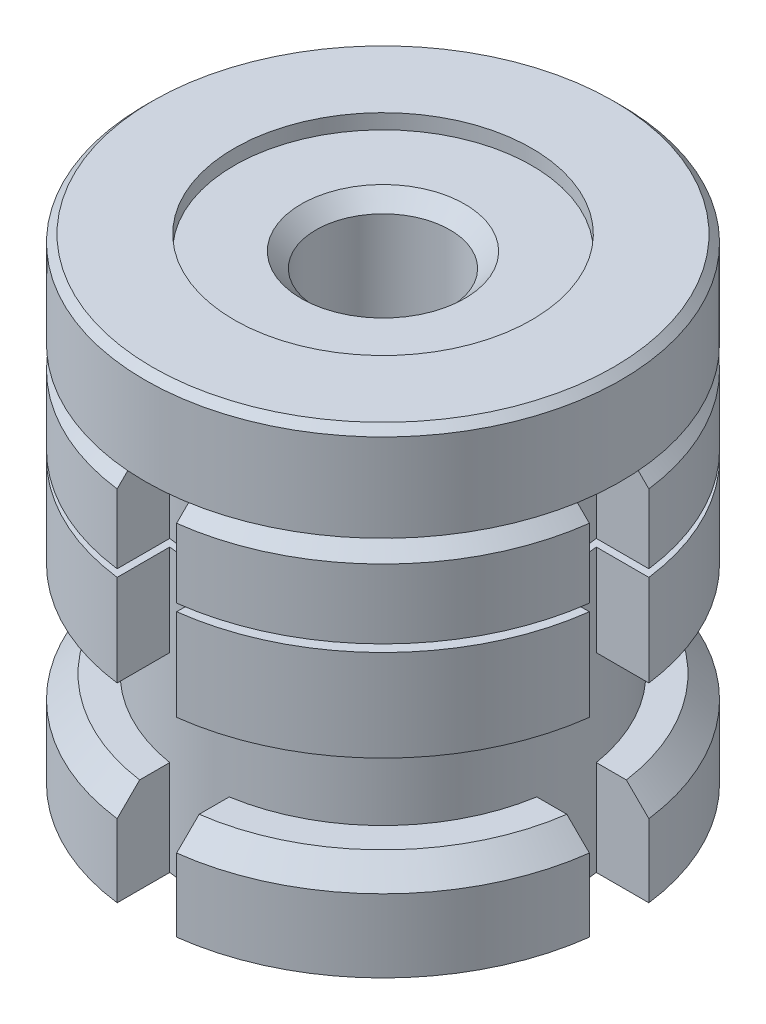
ISO-10303-21;
HEADER;
FILE_DESCRIPTION(('STEP AP214'),'2;1');
FILE_NAME('part.step','',(''),(''),'','','');
FILE_SCHEMA(('AUTOMOTIVE_DESIGN { 1 0 10303 214 1 1 1 1 }'));
ENDSEC;
DATA;
#1=APPLICATION_CONTEXT('core data for automotive mechanical design processes');
#2=APPLICATION_PROTOCOL_DEFINITION('international standard','automotive_design',2000,#1);
#3=PRODUCT_CONTEXT('',#1,'mechanical');
#4=PRODUCT('Part','Part','',(#3));
#5=PRODUCT_RELATED_PRODUCT_CATEGORY('part','',(#4));
#6=PRODUCT_DEFINITION_FORMATION('','',#4);
#7=PRODUCT_DEFINITION_CONTEXT('part definition',#1,'design');
#8=PRODUCT_DEFINITION('design','',#6,#7);
#9=PRODUCT_DEFINITION_SHAPE('','',#8);
#10=(LENGTH_UNIT() NAMED_UNIT(*) SI_UNIT(.MILLI.,.METRE.));
#11=(NAMED_UNIT(*) PLANE_ANGLE_UNIT() SI_UNIT($,.RADIAN.));
#12=(NAMED_UNIT(*) SI_UNIT($,.STERADIAN.) SOLID_ANGLE_UNIT());
#13=UNCERTAINTY_MEASURE_WITH_UNIT(LENGTH_MEASURE(1.E-05),#10,'distance_accuracy_value','');
#14=(GEOMETRIC_REPRESENTATION_CONTEXT(3) GLOBAL_UNCERTAINTY_ASSIGNED_CONTEXT((#13)) GLOBAL_UNIT_ASSIGNED_CONTEXT((#10,
#11,#12)) REPRESENTATION_CONTEXT('',''));
#15=CARTESIAN_POINT('',(0.,0.,0.));
#16=DIRECTION('',(0.,0.,1.));
#17=DIRECTION('',(1.,0.,0.));
#18=AXIS2_PLACEMENT_3D('',#15,#16,#17);
#19=CARTESIAN_POINT('',(0.,12.8,0.));
#20=DIRECTION('',(0.,-1.,0.));
#21=DIRECTION('',(0.,0.,-1.));
#22=AXIS2_PLACEMENT_3D('',#19,#20,#21);
#23=CYLINDRICAL_SURFACE('',#22,16.);
#24=DIRECTION('',(0.,1.,0.));
#25=VECTOR('',#24,1.);
#26=CARTESIAN_POINT('',(-2.00000000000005,-18.2224712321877,15.8745078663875));
#27=LINE('',#26,#25);
#28=CARTESIAN_POINT('',(-2.00000000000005,6.65,15.8745078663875));
#29=VERTEX_POINT('',#28);
#30=CARTESIAN_POINT('',(-2.00000000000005,11.3,15.8745078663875));
#31=VERTEX_POINT('',#30);
#32=EDGE_CURVE('E1108',#29,#31,#27,.T.);
#33=ORIENTED_EDGE('',*,*,#32,.T.);
#34=CARTESIAN_POINT('',(0.,11.3,0.));
#35=DIRECTION('',(0.,1.,0.));
#36=DIRECTION('',(0.,0.,1.));
#37=AXIS2_PLACEMENT_3D('',#34,#35,#36);
#38=CIRCLE('',#37,16.);
#39=CARTESIAN_POINT('',(-15.8745078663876,11.3,1.99999999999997));
#40=VERTEX_POINT('',#39);
#41=EDGE_CURVE('E55',#31,#40,#38,.F.);
#42=ORIENTED_EDGE('',*,*,#41,.T.);
#43=DIRECTION('',(0.,1.,0.));
#44=VECTOR('',#43,1.);
#45=CARTESIAN_POINT('',(-15.8745078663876,-18.2224712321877,1.99999999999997));
#46=LINE('',#45,#44);
#47=CARTESIAN_POINT('',(-15.8745078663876,6.65,1.99999999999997));
#48=VERTEX_POINT('',#47);
#49=EDGE_CURVE('E866',#48,#40,#46,.T.);
#50=ORIENTED_EDGE('',*,*,#49,.F.);
#51=CARTESIAN_POINT('',(0.,6.65,0.));
#52=DIRECTION('',(0.,1.,0.));
#53=DIRECTION('',(0.,0.,1.));
#54=AXIS2_PLACEMENT_3D('',#51,#52,#53);
#55=CIRCLE('',#54,16.);
#56=EDGE_CURVE('E586',#48,#29,#55,.T.);
#57=ORIENTED_EDGE('',*,*,#56,.T.);
#58=EDGE_LOOP('',(#33,#42,#50,#57));
#59=FACE_BOUND('',#58,.T.);
#60=ADVANCED_FACE('F39',(#59),#23,.T.);
#61=DIRECTION('',(0.,1.,0.));
#62=VECTOR('',#61,1.);
#63=CARTESIAN_POINT('',(-15.8745078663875,-18.2224712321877,-2.00000000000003));
#64=LINE('',#63,#62);
#65=CARTESIAN_POINT('',(-15.8745078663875,6.65,-2.00000000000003));
#66=VERTEX_POINT('',#65);
#67=CARTESIAN_POINT('',(-15.8745078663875,11.3,-2.00000000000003));
#68=VERTEX_POINT('',#67);
#69=EDGE_CURVE('E884',#66,#68,#64,.T.);
#70=ORIENTED_EDGE('',*,*,#69,.T.);
#71=CARTESIAN_POINT('',(0.,11.3,0.));
#72=DIRECTION('',(0.,1.,0.));
#73=DIRECTION('',(0.,0.,1.));
#74=AXIS2_PLACEMENT_3D('',#71,#72,#73);
#75=CIRCLE('',#74,16.);
#76=CARTESIAN_POINT('',(-2.00000000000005,11.3,-15.8745078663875));
#77=VERTEX_POINT('',#76);
#78=EDGE_CURVE('E644',#68,#77,#75,.F.);
#79=ORIENTED_EDGE('',*,*,#78,.T.);
#80=DIRECTION('',(0.,1.,0.));
#81=VECTOR('',#80,1.);
#82=CARTESIAN_POINT('',(-2.00000000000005,-18.2224712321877,-15.8745078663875));
#83=LINE('',#82,#81);
#84=CARTESIAN_POINT('',(-2.00000000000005,6.65,-15.8745078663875));
#85=VERTEX_POINT('',#84);
#86=EDGE_CURVE('E462',#85,#77,#83,.T.);
#87=ORIENTED_EDGE('',*,*,#86,.F.);
#88=EDGE_CURVE('E1222',#85,#66,#55,.T.);
#89=ORIENTED_EDGE('',*,*,#88,.T.);
#90=EDGE_LOOP('',(#70,#79,#87,#89));
#91=FACE_BOUND('',#90,.T.);
#92=ADVANCED_FACE('F1235',(#91),#23,.T.);
#93=DIRECTION('',(0.,1.,0.));
#94=VECTOR('',#93,1.);
#95=CARTESIAN_POINT('',(15.8745078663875,-18.2224712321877,2.00000000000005));
#96=LINE('',#95,#94);
#97=CARTESIAN_POINT('',(15.8745078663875,6.65,2.00000000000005));
#98=VERTEX_POINT('',#97);
#99=CARTESIAN_POINT('',(15.8745078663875,11.3,2.00000000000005));
#100=VERTEX_POINT('',#99);
#101=EDGE_CURVE('E1021',#98,#100,#96,.T.);
#102=ORIENTED_EDGE('',*,*,#101,.T.);
#103=CARTESIAN_POINT('',(0.,11.3,0.));
#104=DIRECTION('',(0.,1.,0.));
#105=DIRECTION('',(0.,0.,1.));
#106=AXIS2_PLACEMENT_3D('',#103,#104,#105);
#107=CIRCLE('',#106,16.);
#108=CARTESIAN_POINT('',(2.00000000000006,11.3,15.8745078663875));
#109=VERTEX_POINT('',#108);
#110=EDGE_CURVE('E727',#100,#109,#107,.F.);
#111=ORIENTED_EDGE('',*,*,#110,.T.);
#112=DIRECTION('',(0.,1.,0.));
#113=VECTOR('',#112,1.);
#114=CARTESIAN_POINT('',(2.00000000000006,-18.2224712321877,15.8745078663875));
#115=LINE('',#114,#113);
#116=CARTESIAN_POINT('',(2.00000000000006,6.65,15.8745078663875));
#117=VERTEX_POINT('',#116);
#118=EDGE_CURVE('E1100',#117,#109,#115,.T.);
#119=ORIENTED_EDGE('',*,*,#118,.F.);
#120=EDGE_CURVE('E587',#117,#98,#55,.T.);
#121=ORIENTED_EDGE('',*,*,#120,.T.);
#122=EDGE_LOOP('',(#102,#111,#119,#121));
#123=FACE_BOUND('',#122,.T.);
#124=ADVANCED_FACE('F1098',(#123),#23,.T.);
#125=CARTESIAN_POINT('',(0.,6.65,16.));
#126=DIRECTION('',(0.,1.,0.));
#127=DIRECTION('',(0.,0.,1.));
#128=AXIS2_PLACEMENT_3D('',#125,#126,#127);
#129=PLANE('',#128);
#130=CARTESIAN_POINT('',(0.,6.65,0.));
#131=DIRECTION('',(0.,1.,0.));
#132=DIRECTION('',(0.,0.,1.));
#133=AXIS2_PLACEMENT_3D('',#130,#131,#132);
#134=CIRCLE('',#133,10.);
#135=CARTESIAN_POINT('',(0.,6.65,10.));
#136=VERTEX_POINT('',#135);
#137=EDGE_CURVE('E591',#136,#136,#134,.T.);
#138=ORIENTED_EDGE('',*,*,#137,.T.);
#139=EDGE_LOOP('',(#138));
#140=FACE_BOUND('',#139,.T.);
#141=ORIENTED_EDGE('',*,*,#56,.F.);
#142=DIRECTION('',(1.,0.,0.));
#143=VECTOR('',#142,1.);
#144=CARTESIAN_POINT('',(0.,6.65,1.99999999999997));
#145=LINE('',#144,#143);
#146=CARTESIAN_POINT('',(-12.3389626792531,6.65,1.99999999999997));
#147=VERTEX_POINT('',#146);
#148=EDGE_CURVE('E562',#48,#147,#145,.T.);
#149=ORIENTED_EDGE('',*,*,#148,.T.);
#150=CARTESIAN_POINT('',(0.,6.65,0.));
#151=DIRECTION('',(0.,1.,0.));
#152=DIRECTION('',(0.,0.,1.));
#153=AXIS2_PLACEMENT_3D('',#150,#151,#152);
#154=CIRCLE('',#153,12.5);
#155=CARTESIAN_POINT('',(-12.3389626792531,6.65,-2.00000000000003));
#156=VERTEX_POINT('',#155);
#157=EDGE_CURVE('E546',#147,#156,#154,.F.);
#158=ORIENTED_EDGE('',*,*,#157,.T.);
#159=DIRECTION('',(-1.,0.,0.));
#160=VECTOR('',#159,1.);
#161=CARTESIAN_POINT('',(0.,6.65,-2.00000000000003));
#162=LINE('',#161,#160);
#163=EDGE_CURVE('E539',#156,#66,#162,.T.);
#164=ORIENTED_EDGE('',*,*,#163,.T.);
#165=ORIENTED_EDGE('',*,*,#88,.F.);
#166=DIRECTION('',(0.,0.,1.));
#167=VECTOR('',#166,1.);
#168=CARTESIAN_POINT('',(-2.00000000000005,6.65,16.));
#169=LINE('',#168,#167);
#170=CARTESIAN_POINT('',(-2.00000000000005,6.65,-12.3389626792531));
#171=VERTEX_POINT('',#170);
#172=EDGE_CURVE('E525',#85,#171,#169,.T.);
#173=ORIENTED_EDGE('',*,*,#172,.T.);
#174=CARTESIAN_POINT('',(0.,6.65,0.));
#175=DIRECTION('',(0.,1.,0.));
#176=DIRECTION('',(0.,0.,1.));
#177=AXIS2_PLACEMENT_3D('',#174,#175,#176);
#178=CIRCLE('',#177,12.5);
#179=CARTESIAN_POINT('',(2.00000000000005,6.65,-12.3389626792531));
#180=VERTEX_POINT('',#179);
#181=EDGE_CURVE('E422',#171,#180,#178,.F.);
#182=ORIENTED_EDGE('',*,*,#181,.T.);
#183=DIRECTION('',(0.,0.,-1.));
#184=VECTOR('',#183,1.);
#185=CARTESIAN_POINT('',(2.00000000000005,6.65,16.));
#186=LINE('',#185,#184);
#187=CARTESIAN_POINT('',(2.00000000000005,6.65,-15.8745078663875));
#188=VERTEX_POINT('',#187);
#189=EDGE_CURVE('E499',#180,#188,#186,.T.);
#190=ORIENTED_EDGE('',*,*,#189,.T.);
#191=CARTESIAN_POINT('',(15.8745078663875,6.65,-2.00000000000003));
#192=VERTEX_POINT('',#191);
#193=EDGE_CURVE('E592',#192,#188,#55,.T.);
#194=ORIENTED_EDGE('',*,*,#193,.F.);
#195=DIRECTION('',(-1.,0.,0.));
#196=VECTOR('',#195,1.);
#197=CARTESIAN_POINT('',(0.,6.65,-2.00000000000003));
#198=LINE('',#197,#196);
#199=CARTESIAN_POINT('',(12.3389626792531,6.65,-2.00000000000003));
#200=VERTEX_POINT('',#199);
#201=EDGE_CURVE('E1064',#192,#200,#198,.T.);
#202=ORIENTED_EDGE('',*,*,#201,.T.);
#203=CARTESIAN_POINT('',(0.,6.65,0.));
#204=DIRECTION('',(0.,1.,0.));
#205=DIRECTION('',(0.,0.,1.));
#206=AXIS2_PLACEMENT_3D('',#203,#204,#205);
#207=CIRCLE('',#206,12.5);
#208=CARTESIAN_POINT('',(12.3389626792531,6.65,2.00000000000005));
#209=VERTEX_POINT('',#208);
#210=EDGE_CURVE('E1062',#200,#209,#207,.F.);
#211=ORIENTED_EDGE('',*,*,#210,.T.);
#212=DIRECTION('',(1.,0.,0.));
#213=VECTOR('',#212,1.);
#214=CARTESIAN_POINT('',(0.,6.65,2.00000000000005));
#215=LINE('',#214,#213);
#216=EDGE_CURVE('E991',#209,#98,#215,.T.);
#217=ORIENTED_EDGE('',*,*,#216,.T.);
#218=ORIENTED_EDGE('',*,*,#120,.F.);
#219=DIRECTION('',(0.,0.,-1.));
#220=VECTOR('',#219,1.);
#221=CARTESIAN_POINT('',(2.00000000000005,6.65,16.));
#222=LINE('',#221,#220);
#223=CARTESIAN_POINT('',(2.00000000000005,6.65,12.3389626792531));
#224=VERTEX_POINT('',#223);
#225=EDGE_CURVE('E847',#117,#224,#222,.T.);
#226=ORIENTED_EDGE('',*,*,#225,.T.);
#227=CARTESIAN_POINT('',(0.,6.65,0.));
#228=DIRECTION('',(0.,1.,0.));
#229=DIRECTION('',(0.,0.,1.));
#230=AXIS2_PLACEMENT_3D('',#227,#228,#229);
#231=CIRCLE('',#230,12.5);
#232=CARTESIAN_POINT('',(-2.00000000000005,6.65,12.3389626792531));
#233=VERTEX_POINT('',#232);
#234=EDGE_CURVE('E871',#224,#233,#231,.F.);
#235=ORIENTED_EDGE('',*,*,#234,.T.);
#236=DIRECTION('',(0.,0.,1.));
#237=VECTOR('',#236,1.);
#238=CARTESIAN_POINT('',(-2.00000000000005,6.65,16.));
#239=LINE('',#238,#237);
#240=EDGE_CURVE('E1151',#233,#29,#239,.T.);
#241=ORIENTED_EDGE('',*,*,#240,.T.);
#242=EDGE_LOOP('',(#141,#149,#158,#164,#165,#173,#182,#190,#194,#202,#211,#217,#218,#226,#235,#241));
#243=FACE_BOUND('',#242,.T.);
#244=ADVANCED_FACE('F1068',(#140,#243),#129,.F.);
#245=CARTESIAN_POINT('',(0.,6.15,16.));
#246=DIRECTION('',(0.,-1.,0.));
#247=DIRECTION('',(0.,0.,-1.));
#248=AXIS2_PLACEMENT_3D('',#245,#246,#247);
#249=PLANE('',#248);
#250=CARTESIAN_POINT('',(0.,6.15,0.));
#251=DIRECTION('',(0.,1.,0.));
#252=DIRECTION('',(0.,0.,1.));
#253=AXIS2_PLACEMENT_3D('',#250,#251,#252);
#254=CIRCLE('',#253,10.);
#255=CARTESIAN_POINT('',(0.,6.15,10.));
#256=VERTEX_POINT('',#255);
#257=EDGE_CURVE('E571',#256,#256,#254,.T.);
#258=ORIENTED_EDGE('',*,*,#257,.F.);
#259=EDGE_LOOP('',(#258));
#260=FACE_BOUND('',#259,.T.);
#261=CARTESIAN_POINT('',(0.,6.15,0.));
#262=DIRECTION('',(0.,-1.,0.));
#263=DIRECTION('',(0.,0.,-1.));
#264=AXIS2_PLACEMENT_3D('',#261,#262,#263);
#265=CIRCLE('',#264,12.5);
#266=CARTESIAN_POINT('',(-12.3389626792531,6.15,-2.00000000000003));
#267=VERTEX_POINT('',#266);
#268=CARTESIAN_POINT('',(-12.3389626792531,6.15,1.99999999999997));
#269=VERTEX_POINT('',#268);
#270=EDGE_CURVE('E543',#267,#269,#265,.F.);
#271=ORIENTED_EDGE('',*,*,#270,.T.);
#272=DIRECTION('',(-1.,0.,0.));
#273=VECTOR('',#272,1.);
#274=CARTESIAN_POINT('',(0.,6.15,1.99999999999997));
#275=LINE('',#274,#273);
#276=CARTESIAN_POINT('',(-15.8745078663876,6.15,1.99999999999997));
#277=VERTEX_POINT('',#276);
#278=EDGE_CURVE('E558',#269,#277,#275,.T.);
#279=ORIENTED_EDGE('',*,*,#278,.T.);
#280=CARTESIAN_POINT('',(0.,6.15,0.));
#281=DIRECTION('',(0.,1.,0.));
#282=DIRECTION('',(0.,0.,1.));
#283=AXIS2_PLACEMENT_3D('',#280,#281,#282);
#284=CIRCLE('',#283,16.);
#285=CARTESIAN_POINT('',(-2.00000000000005,6.15,15.8745078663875));
#286=VERTEX_POINT('',#285);
#287=EDGE_CURVE('E582',#277,#286,#284,.T.);
#288=ORIENTED_EDGE('',*,*,#287,.T.);
#289=DIRECTION('',(0.,0.,-1.));
#290=VECTOR('',#289,1.);
#291=CARTESIAN_POINT('',(-2.00000000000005,6.15,16.));
#292=LINE('',#291,#290);
#293=CARTESIAN_POINT('',(-2.00000000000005,6.15,12.3389626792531));
#294=VERTEX_POINT('',#293);
#295=EDGE_CURVE('E1146',#286,#294,#292,.T.);
#296=ORIENTED_EDGE('',*,*,#295,.T.);
#297=CARTESIAN_POINT('',(0.,6.15,0.));
#298=DIRECTION('',(0.,-1.,0.));
#299=DIRECTION('',(0.,0.,-1.));
#300=AXIS2_PLACEMENT_3D('',#297,#298,#299);
#301=CIRCLE('',#300,12.5);
#302=CARTESIAN_POINT('',(2.00000000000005,6.15,12.3389626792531));
#303=VERTEX_POINT('',#302);
#304=EDGE_CURVE('E863',#294,#303,#301,.F.);
#305=ORIENTED_EDGE('',*,*,#304,.T.);
#306=DIRECTION('',(0.,0.,1.));
#307=VECTOR('',#306,1.);
#308=CARTESIAN_POINT('',(2.00000000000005,6.15,16.));
#309=LINE('',#308,#307);
#310=CARTESIAN_POINT('',(2.00000000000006,6.15,15.8745078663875));
#311=VERTEX_POINT('',#310);
#312=EDGE_CURVE('E1143',#303,#311,#309,.T.);
#313=ORIENTED_EDGE('',*,*,#312,.T.);
#314=CARTESIAN_POINT('',(15.8745078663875,6.15,2.00000000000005));
#315=VERTEX_POINT('',#314);
#316=EDGE_CURVE('E583',#311,#315,#284,.T.);
#317=ORIENTED_EDGE('',*,*,#316,.T.);
#318=DIRECTION('',(-1.,0.,0.));
#319=VECTOR('',#318,1.);
#320=CARTESIAN_POINT('',(0.,6.15,2.00000000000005));
#321=LINE('',#320,#319);
#322=CARTESIAN_POINT('',(12.3389626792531,6.15,2.00000000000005));
#323=VERTEX_POINT('',#322);
#324=EDGE_CURVE('E1086',#315,#323,#321,.T.);
#325=ORIENTED_EDGE('',*,*,#324,.T.);
#326=CARTESIAN_POINT('',(0.,6.15,0.));
#327=DIRECTION('',(0.,-1.,0.));
#328=DIRECTION('',(0.,0.,-1.));
#329=AXIS2_PLACEMENT_3D('',#326,#327,#328);
#330=CIRCLE('',#329,12.5);
#331=CARTESIAN_POINT('',(12.3389626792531,6.15,-2.00000000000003));
#332=VERTEX_POINT('',#331);
#333=EDGE_CURVE('E1157',#323,#332,#330,.F.);
#334=ORIENTED_EDGE('',*,*,#333,.T.);
#335=DIRECTION('',(1.,0.,0.));
#336=VECTOR('',#335,1.);
#337=CARTESIAN_POINT('',(0.,6.15,-2.00000000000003));
#338=LINE('',#337,#336);
#339=CARTESIAN_POINT('',(15.8745078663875,6.15,-2.00000000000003));
#340=VERTEX_POINT('',#339);
#341=EDGE_CURVE('E1073',#332,#340,#338,.T.);
#342=ORIENTED_EDGE('',*,*,#341,.T.);
#343=CARTESIAN_POINT('',(2.00000000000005,6.15,-15.8745078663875));
#344=VERTEX_POINT('',#343);
#345=EDGE_CURVE('E497',#340,#344,#284,.T.);
#346=ORIENTED_EDGE('',*,*,#345,.T.);
#347=DIRECTION('',(0.,0.,1.));
#348=VECTOR('',#347,1.);
#349=CARTESIAN_POINT('',(2.00000000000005,6.15,16.));
#350=LINE('',#349,#348);
#351=CARTESIAN_POINT('',(2.00000000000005,6.15,-12.3389626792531));
#352=VERTEX_POINT('',#351);
#353=EDGE_CURVE('E481',#344,#352,#350,.T.);
#354=ORIENTED_EDGE('',*,*,#353,.T.);
#355=CARTESIAN_POINT('',(0.,6.15,0.));
#356=DIRECTION('',(0.,-1.,0.));
#357=DIRECTION('',(0.,0.,-1.));
#358=AXIS2_PLACEMENT_3D('',#355,#356,#357);
#359=CIRCLE('',#358,12.5);
#360=CARTESIAN_POINT('',(-2.00000000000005,6.15,-12.3389626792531));
#361=VERTEX_POINT('',#360);
#362=EDGE_CURVE('E494',#352,#361,#359,.F.);
#363=ORIENTED_EDGE('',*,*,#362,.T.);
#364=DIRECTION('',(0.,0.,-1.));
#365=VECTOR('',#364,1.);
#366=CARTESIAN_POINT('',(-2.00000000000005,6.15,16.));
#367=LINE('',#366,#365);
#368=CARTESIAN_POINT('',(-2.00000000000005,6.15,-15.8745078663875));
#369=VERTEX_POINT('',#368);
#370=EDGE_CURVE('E522',#361,#369,#367,.T.);
#371=ORIENTED_EDGE('',*,*,#370,.T.);
#372=CARTESIAN_POINT('',(-15.8745078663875,6.15,-2.00000000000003));
#373=VERTEX_POINT('',#372);
#374=EDGE_CURVE('E1294',#369,#373,#284,.T.);
#375=ORIENTED_EDGE('',*,*,#374,.T.);
#376=DIRECTION('',(1.,0.,0.));
#377=VECTOR('',#376,1.);
#378=CARTESIAN_POINT('',(0.,6.15,-2.00000000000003));
#379=LINE('',#378,#377);
#380=EDGE_CURVE('E535',#373,#267,#379,.T.);
#381=ORIENTED_EDGE('',*,*,#380,.T.);
#382=EDGE_LOOP('',(#271,#279,#288,#296,#305,#313,#317,#325,#334,#342,#346,#354,#363,#371,#375,#381));
#383=FACE_BOUND('',#382,.T.);
#384=ADVANCED_FACE('F492',(#260,#383),#249,.F.);
#385=CARTESIAN_POINT('',(0.,0.,0.));
#386=DIRECTION('',(0.,1.,0.));
#387=DIRECTION('',(0.,0.,1.));
#388=AXIS2_PLACEMENT_3D('',#385,#386,#387);
#389=PLANE('',#388);
#390=CARTESIAN_POINT('',(0.,0.,0.));
#391=DIRECTION('',(0.,1.,0.));
#392=DIRECTION('',(0.,0.,1.));
#393=AXIS2_PLACEMENT_3D('',#390,#391,#392);
#394=CIRCLE('',#393,16.);
#395=CARTESIAN_POINT('',(-15.8745078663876,0.,1.99999999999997));
#396=VERTEX_POINT('',#395);
#397=CARTESIAN_POINT('',(-2.00000000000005,0.,15.8745078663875));
#398=VERTEX_POINT('',#397);
#399=EDGE_CURVE('E596',#396,#398,#394,.T.);
#400=ORIENTED_EDGE('',*,*,#399,.F.);
#401=DIRECTION('',(1.,0.,0.));
#402=VECTOR('',#401,1.);
#403=CARTESIAN_POINT('',(0.,0.,1.99999999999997));
#404=LINE('',#403,#402);
#405=CARTESIAN_POINT('',(-12.3389626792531,0.,1.99999999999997));
#406=VERTEX_POINT('',#405);
#407=EDGE_CURVE('E554',#396,#406,#404,.T.);
#408=ORIENTED_EDGE('',*,*,#407,.T.);
#409=CARTESIAN_POINT('',(0.,0.,0.));
#410=DIRECTION('',(0.,-1.,0.));
#411=DIRECTION('',(0.,0.,-1.));
#412=AXIS2_PLACEMENT_3D('',#409,#410,#411);
#413=CIRCLE('',#412,12.5);
#414=CARTESIAN_POINT('',(-2.00000000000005,0.,12.3389626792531));
#415=VERTEX_POINT('',#414);
#416=EDGE_CURVE('E1289',#415,#406,#413,.T.);
#417=ORIENTED_EDGE('',*,*,#416,.F.);
#418=DIRECTION('',(0.,0.,1.));
#419=VECTOR('',#418,1.);
#420=CARTESIAN_POINT('',(-2.00000000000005,0.,0.));
#421=LINE('',#420,#419);
#422=EDGE_CURVE('E846',#415,#398,#421,.T.);
#423=ORIENTED_EDGE('',*,*,#422,.T.);
#424=EDGE_LOOP('',(#400,#408,#417,#423));
#425=FACE_BOUND('',#424,.T.);
#426=ADVANCED_FACE('F1250',(#425),#389,.F.);
#427=CARTESIAN_POINT('',(-12.3389626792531,0.,-2.00000000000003));
#428=VERTEX_POINT('',#427);
#429=CARTESIAN_POINT('',(-2.00000000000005,0.,-12.3389626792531));
#430=VERTEX_POINT('',#429);
#431=EDGE_CURVE('E578',#428,#430,#413,.T.);
#432=ORIENTED_EDGE('',*,*,#431,.F.);
#433=DIRECTION('',(-1.,0.,0.));
#434=VECTOR('',#433,1.);
#435=CARTESIAN_POINT('',(0.,0.,-2.00000000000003));
#436=LINE('',#435,#434);
#437=CARTESIAN_POINT('',(-15.8745078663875,0.,-2.00000000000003));
#438=VERTEX_POINT('',#437);
#439=EDGE_CURVE('E531',#428,#438,#436,.T.);
#440=ORIENTED_EDGE('',*,*,#439,.T.);
#441=CARTESIAN_POINT('',(-2.00000000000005,0.,-15.8745078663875));
#442=VERTEX_POINT('',#441);
#443=EDGE_CURVE('E1276',#442,#438,#394,.T.);
#444=ORIENTED_EDGE('',*,*,#443,.F.);
#445=DIRECTION('',(0.,0.,1.));
#446=VECTOR('',#445,1.);
#447=CARTESIAN_POINT('',(-2.00000000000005,0.,0.));
#448=LINE('',#447,#446);
#449=EDGE_CURVE('E518',#442,#430,#448,.T.);
#450=ORIENTED_EDGE('',*,*,#449,.T.);
#451=EDGE_LOOP('',(#432,#440,#444,#450));
#452=FACE_BOUND('',#451,.T.);
#453=ADVANCED_FACE('F1808',(#452),#389,.F.);
#454=CARTESIAN_POINT('',(12.3389626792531,0.,2.00000000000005));
#455=VERTEX_POINT('',#454);
#456=CARTESIAN_POINT('',(2.00000000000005,0.,12.3389626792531));
#457=VERTEX_POINT('',#456);
#458=EDGE_CURVE('E577',#455,#457,#413,.T.);
#459=ORIENTED_EDGE('',*,*,#458,.F.);
#460=DIRECTION('',(1.,0.,0.));
#461=VECTOR('',#460,1.);
#462=CARTESIAN_POINT('',(0.,0.,2.00000000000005));
#463=LINE('',#462,#461);
#464=CARTESIAN_POINT('',(15.8745078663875,0.,2.00000000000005));
#465=VERTEX_POINT('',#464);
#466=EDGE_CURVE('E1076',#455,#465,#463,.T.);
#467=ORIENTED_EDGE('',*,*,#466,.T.);
#468=CARTESIAN_POINT('',(2.00000000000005,0.,15.8745078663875));
#469=VERTEX_POINT('',#468);
#470=EDGE_CURVE('E597',#469,#465,#394,.T.);
#471=ORIENTED_EDGE('',*,*,#470,.F.);
#472=DIRECTION('',(0.,0.,-1.));
#473=VECTOR('',#472,1.);
#474=CARTESIAN_POINT('',(2.00000000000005,0.,0.));
#475=LINE('',#474,#473);
#476=EDGE_CURVE('E1187',#469,#457,#475,.T.);
#477=ORIENTED_EDGE('',*,*,#476,.T.);
#478=EDGE_LOOP('',(#459,#467,#471,#477));
#479=FACE_BOUND('',#478,.T.);
#480=ADVANCED_FACE('F1186',(#479),#389,.F.);
#481=ORIENTED_EDGE('',*,*,#287,.F.);
#482=EDGE_CURVE('E864',#396,#277,#46,.T.);
#483=ORIENTED_EDGE('',*,*,#482,.F.);
#484=ORIENTED_EDGE('',*,*,#399,.T.);
#485=EDGE_CURVE('E1106',#398,#286,#27,.T.);
#486=ORIENTED_EDGE('',*,*,#485,.T.);
#487=EDGE_LOOP('',(#481,#483,#484,#486));
#488=FACE_BOUND('',#487,.T.);
#489=ADVANCED_FACE('F1267',(#488),#23,.T.);
#490=ORIENTED_EDGE('',*,*,#443,.T.);
#491=EDGE_CURVE('E882',#438,#373,#64,.T.);
#492=ORIENTED_EDGE('',*,*,#491,.T.);
#493=ORIENTED_EDGE('',*,*,#374,.F.);
#494=EDGE_CURVE('E952',#442,#369,#83,.T.);
#495=ORIENTED_EDGE('',*,*,#494,.F.);
#496=EDGE_LOOP('',(#490,#492,#493,#495));
#497=FACE_BOUND('',#496,.T.);
#498=ADVANCED_FACE('F1261',(#497),#23,.T.);
#499=ORIENTED_EDGE('',*,*,#470,.T.);
#500=EDGE_CURVE('E1020',#465,#315,#96,.T.);
#501=ORIENTED_EDGE('',*,*,#500,.T.);
#502=ORIENTED_EDGE('',*,*,#316,.F.);
#503=EDGE_CURVE('E1102',#469,#311,#115,.T.);
#504=ORIENTED_EDGE('',*,*,#503,.F.);
#505=EDGE_LOOP('',(#499,#501,#502,#504));
#506=FACE_BOUND('',#505,.T.);
#507=ADVANCED_FACE('F1182',(#506),#23,.T.);
#508=CARTESIAN_POINT('',(0.,-6.4,0.));
#509=DIRECTION('',(0.,-1.,0.));
#510=DIRECTION('',(0.,0.,-1.));
#511=AXIS2_PLACEMENT_3D('',#508,#509,#510);
#512=CYLINDRICAL_SURFACE('',#511,16.);
#513=CARTESIAN_POINT('',(-2.00000000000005,-12.8,15.8745078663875));
#514=VERTEX_POINT('',#513);
#515=CARTESIAN_POINT('',(-2.00000000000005,-7.9,15.8745078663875));
#516=VERTEX_POINT('',#515);
#517=EDGE_CURVE('E857',#514,#516,#27,.T.);
#518=ORIENTED_EDGE('',*,*,#517,.T.);
#519=CARTESIAN_POINT('',(0.,-7.9,0.));
#520=DIRECTION('',(0.,-1.,0.));
#521=DIRECTION('',(0.,0.,-1.));
#522=AXIS2_PLACEMENT_3D('',#519,#520,#521);
#523=CIRCLE('',#522,16.);
#524=CARTESIAN_POINT('',(-15.8745078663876,-7.9,1.99999999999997));
#525=VERTEX_POINT('',#524);
#526=EDGE_CURVE('E775',#516,#525,#523,.T.);
#527=ORIENTED_EDGE('',*,*,#526,.T.);
#528=CARTESIAN_POINT('',(-15.8745078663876,-12.8,1.99999999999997));
#529=VERTEX_POINT('',#528);
#530=EDGE_CURVE('E855',#529,#525,#46,.T.);
#531=ORIENTED_EDGE('',*,*,#530,.F.);
#532=CARTESIAN_POINT('',(0.,-12.8,0.));
#533=DIRECTION('',(0.,-1.,0.));
#534=DIRECTION('',(0.,0.,-1.));
#535=AXIS2_PLACEMENT_3D('',#532,#533,#534);
#536=CIRCLE('',#535,16.);
#537=EDGE_CURVE('E1903',#514,#529,#536,.T.);
#538=ORIENTED_EDGE('',*,*,#537,.F.);
#539=EDGE_LOOP('',(#518,#527,#531,#538));
#540=FACE_BOUND('',#539,.T.);
#541=ADVANCED_FACE('F853',(#540),#512,.T.);
#542=CARTESIAN_POINT('',(-15.8745078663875,-12.8,-2.00000000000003));
#543=VERTEX_POINT('',#542);
#544=CARTESIAN_POINT('',(-15.8745078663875,-7.9,-2.00000000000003));
#545=VERTEX_POINT('',#544);
#546=EDGE_CURVE('E877',#543,#545,#64,.T.);
#547=ORIENTED_EDGE('',*,*,#546,.T.);
#548=CARTESIAN_POINT('',(0.,-7.9,0.));
#549=DIRECTION('',(0.,-1.,0.));
#550=DIRECTION('',(0.,0.,-1.));
#551=AXIS2_PLACEMENT_3D('',#548,#549,#550);
#552=CIRCLE('',#551,16.);
#553=CARTESIAN_POINT('',(-2.00000000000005,-7.9,-15.8745078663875));
#554=VERTEX_POINT('',#553);
#555=EDGE_CURVE('E606',#545,#554,#552,.T.);
#556=ORIENTED_EDGE('',*,*,#555,.T.);
#557=CARTESIAN_POINT('',(-2.00000000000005,-12.8,-15.8745078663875));
#558=VERTEX_POINT('',#557);
#559=EDGE_CURVE('E949',#558,#554,#83,.T.);
#560=ORIENTED_EDGE('',*,*,#559,.F.);
#561=EDGE_CURVE('E566',#543,#558,#536,.T.);
#562=ORIENTED_EDGE('',*,*,#561,.F.);
#563=EDGE_LOOP('',(#547,#556,#560,#562));
#564=FACE_BOUND('',#563,.T.);
#565=ADVANCED_FACE('F1266',(#564),#512,.T.);
#566=CARTESIAN_POINT('',(15.8745078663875,-12.8,2.00000000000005));
#567=VERTEX_POINT('',#566);
#568=CARTESIAN_POINT('',(15.8745078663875,-7.9,2.00000000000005));
#569=VERTEX_POINT('',#568);
#570=EDGE_CURVE('E1013',#567,#569,#96,.T.);
#571=ORIENTED_EDGE('',*,*,#570,.T.);
#572=CARTESIAN_POINT('',(0.,-7.9,0.));
#573=DIRECTION('',(0.,-1.,0.));
#574=DIRECTION('',(0.,0.,-1.));
#575=AXIS2_PLACEMENT_3D('',#572,#573,#574);
#576=CIRCLE('',#575,16.);
#577=CARTESIAN_POINT('',(2.00000000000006,-7.9,15.8745078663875));
#578=VERTEX_POINT('',#577);
#579=EDGE_CURVE('E746',#569,#578,#576,.T.);
#580=ORIENTED_EDGE('',*,*,#579,.T.);
#581=CARTESIAN_POINT('',(2.00000000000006,-12.8,15.8745078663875));
#582=VERTEX_POINT('',#581);
#583=EDGE_CURVE('E1104',#582,#578,#115,.T.);
#584=ORIENTED_EDGE('',*,*,#583,.F.);
#585=EDGE_CURVE('E572',#567,#582,#536,.T.);
#586=ORIENTED_EDGE('',*,*,#585,.F.);
#587=EDGE_LOOP('',(#571,#580,#584,#586));
#588=FACE_BOUND('',#587,.T.);
#589=ADVANCED_FACE('F1248',(#588),#512,.T.);
#590=CARTESIAN_POINT('',(0.,-6.4,0.));
#591=DIRECTION('',(0.,-1.,0.));
#592=DIRECTION('',(0.,0.,-1.));
#593=AXIS2_PLACEMENT_3D('',#590,#591,#592);
#594=PLANE('',#593);
#595=DIRECTION('',(-1.,0.,0.));
#596=VECTOR('',#595,1.);
#597=CARTESIAN_POINT('',(0.,-6.4,1.99999999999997));
#598=LINE('',#597,#596);
#599=CARTESIAN_POINT('',(-12.3389626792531,-6.4,1.99999999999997));
#600=VERTEX_POINT('',#599);
#601=CARTESIAN_POINT('',(-14.3614066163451,-6.4,1.99999999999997));
#602=VERTEX_POINT('',#601);
#603=EDGE_CURVE('E550',#600,#602,#598,.T.);
#604=ORIENTED_EDGE('',*,*,#603,.T.);
#605=CARTESIAN_POINT('',(0.,-6.4,0.));
#606=DIRECTION('',(0.,-1.,0.));
#607=DIRECTION('',(0.,0.,-1.));
#608=AXIS2_PLACEMENT_3D('',#605,#606,#607);
#609=CIRCLE('',#608,14.5);
#610=CARTESIAN_POINT('',(-2.00000000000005,-6.4,14.3614066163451));
#611=VERTEX_POINT('',#610);
#612=EDGE_CURVE('E785',#602,#611,#609,.F.);
#613=ORIENTED_EDGE('',*,*,#612,.T.);
#614=DIRECTION('',(0.,0.,-1.));
#615=VECTOR('',#614,1.);
#616=CARTESIAN_POINT('',(-2.00000000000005,-6.4,0.));
#617=LINE('',#616,#615);
#618=CARTESIAN_POINT('',(-2.00000000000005,-6.4,12.3389626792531));
#619=VERTEX_POINT('',#618);
#620=EDGE_CURVE('E839',#611,#619,#617,.T.);
#621=ORIENTED_EDGE('',*,*,#620,.T.);
#622=CARTESIAN_POINT('',(0.,-6.4,0.));
#623=DIRECTION('',(0.,-1.,0.));
#624=DIRECTION('',(0.,0.,-1.));
#625=AXIS2_PLACEMENT_3D('',#622,#623,#624);
#626=CIRCLE('',#625,12.5);
#627=EDGE_CURVE('E1899',#619,#600,#626,.T.);
#628=ORIENTED_EDGE('',*,*,#627,.T.);
#629=EDGE_LOOP('',(#604,#613,#621,#628));
#630=FACE_BOUND('',#629,.T.);
#631=ADVANCED_FACE('F837',(#630),#594,.F.);
#632=DIRECTION('',(0.,0.,-1.));
#633=VECTOR('',#632,1.);
#634=CARTESIAN_POINT('',(-2.00000000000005,-6.4,0.));
#635=LINE('',#634,#633);
#636=CARTESIAN_POINT('',(-2.00000000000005,-6.4,-12.3389626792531));
#637=VERTEX_POINT('',#636);
#638=CARTESIAN_POINT('',(-2.00000000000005,-6.4,-14.3614066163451));
#639=VERTEX_POINT('',#638);
#640=EDGE_CURVE('E514',#637,#639,#635,.T.);
#641=ORIENTED_EDGE('',*,*,#640,.T.);
#642=CARTESIAN_POINT('',(0.,-6.4,0.));
#643=DIRECTION('',(0.,-1.,0.));
#644=DIRECTION('',(0.,0.,-1.));
#645=AXIS2_PLACEMENT_3D('',#642,#643,#644);
#646=CIRCLE('',#645,14.5);
#647=CARTESIAN_POINT('',(-14.3614066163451,-6.4,-2.00000000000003));
#648=VERTEX_POINT('',#647);
#649=EDGE_CURVE('E619',#639,#648,#646,.F.);
#650=ORIENTED_EDGE('',*,*,#649,.T.);
#651=DIRECTION('',(1.,0.,0.));
#652=VECTOR('',#651,1.);
#653=CARTESIAN_POINT('',(0.,-6.4,-2.00000000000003));
#654=LINE('',#653,#652);
#655=CARTESIAN_POINT('',(-12.3389626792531,-6.4,-2.00000000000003));
#656=VERTEX_POINT('',#655);
#657=EDGE_CURVE('E528',#648,#656,#654,.T.);
#658=ORIENTED_EDGE('',*,*,#657,.T.);
#659=EDGE_CURVE('E576',#656,#637,#626,.T.);
#660=ORIENTED_EDGE('',*,*,#659,.T.);
#661=EDGE_LOOP('',(#641,#650,#658,#660));
#662=FACE_BOUND('',#661,.T.);
#663=ADVANCED_FACE('F1751',(#662),#594,.F.);
#664=DIRECTION('',(0.,0.,1.));
#665=VECTOR('',#664,1.);
#666=CARTESIAN_POINT('',(2.00000000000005,-6.4,0.));
#667=LINE('',#666,#665);
#668=CARTESIAN_POINT('',(2.00000000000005,-6.4,12.3389626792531));
#669=VERTEX_POINT('',#668);
#670=CARTESIAN_POINT('',(2.00000000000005,-6.4,14.3614066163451));
#671=VERTEX_POINT('',#670);
#672=EDGE_CURVE('E1210',#669,#671,#667,.T.);
#673=ORIENTED_EDGE('',*,*,#672,.T.);
#674=CARTESIAN_POINT('',(0.,-6.4,0.));
#675=DIRECTION('',(0.,-1.,0.));
#676=DIRECTION('',(0.,0.,-1.));
#677=AXIS2_PLACEMENT_3D('',#674,#675,#676);
#678=CIRCLE('',#677,14.5);
#679=CARTESIAN_POINT('',(14.3614066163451,-6.4,2.00000000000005));
#680=VERTEX_POINT('',#679);
#681=EDGE_CURVE('E766',#671,#680,#678,.F.);
#682=ORIENTED_EDGE('',*,*,#681,.T.);
#683=DIRECTION('',(-1.,0.,0.));
#684=VECTOR('',#683,1.);
#685=CARTESIAN_POINT('',(0.,-6.4,2.00000000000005));
#686=LINE('',#685,#684);
#687=CARTESIAN_POINT('',(12.3389626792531,-6.4,2.00000000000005));
#688=VERTEX_POINT('',#687);
#689=EDGE_CURVE('E1072',#680,#688,#686,.T.);
#690=ORIENTED_EDGE('',*,*,#689,.T.);
#691=EDGE_CURVE('E607',#688,#669,#626,.T.);
#692=ORIENTED_EDGE('',*,*,#691,.T.);
#693=EDGE_LOOP('',(#673,#682,#690,#692));
#694=FACE_BOUND('',#693,.T.);
#695=ADVANCED_FACE('F1701',(#694),#594,.F.);
#696=CARTESIAN_POINT('',(0.,-12.8,0.));
#697=DIRECTION('',(0.,-1.,0.));
#698=DIRECTION('',(0.,0.,-1.));
#699=AXIS2_PLACEMENT_3D('',#696,#697,#698);
#700=PLANE('',#699);
#701=CARTESIAN_POINT('',(0.,-12.8,0.));
#702=DIRECTION('',(0.,-1.,0.));
#703=DIRECTION('',(0.,0.,-1.));
#704=AXIS2_PLACEMENT_3D('',#701,#702,#703);
#705=CIRCLE('',#704,5.49999999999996);
#706=CARTESIAN_POINT('',(0.,-12.8,-5.49999999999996));
#707=VERTEX_POINT('',#706);
#708=EDGE_CURVE('E1911',#707,#707,#705,.F.);
#709=ORIENTED_EDGE('',*,*,#708,.T.);
#710=EDGE_LOOP('',(#709));
#711=FACE_BOUND('',#710,.T.);
#712=DIRECTION('',(1.,0.,0.));
#713=VECTOR('',#712,1.);
#714=CARTESIAN_POINT('',(-12.3389626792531,-12.8,1.99999999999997));
#715=LINE('',#714,#713);
#716=CARTESIAN_POINT('',(-12.3389626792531,-12.8,1.99999999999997));
#717=VERTEX_POINT('',#716);
#718=EDGE_CURVE('E861',#529,#717,#715,.T.);
#719=ORIENTED_EDGE('',*,*,#718,.T.);
#720=CARTESIAN_POINT('',(0.,-12.8,0.));
#721=DIRECTION('',(0.,-1.,0.));
#722=DIRECTION('',(0.,0.,-1.));
#723=AXIS2_PLACEMENT_3D('',#720,#721,#722);
#724=CIRCLE('',#723,12.5);
#725=CARTESIAN_POINT('',(-12.3389626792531,-12.8,-2.00000000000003));
#726=VERTEX_POINT('',#725);
#727=EDGE_CURVE('E914',#717,#726,#724,.T.);
#728=ORIENTED_EDGE('',*,*,#727,.T.);
#729=DIRECTION('',(-1.,0.,0.));
#730=VECTOR('',#729,1.);
#731=CARTESIAN_POINT('',(-15.8745078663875,-12.8,-2.00000000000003));
#732=LINE('',#731,#730);
#733=EDGE_CURVE('E895',#726,#543,#732,.T.);
#734=ORIENTED_EDGE('',*,*,#733,.T.);
#735=ORIENTED_EDGE('',*,*,#561,.T.);
#736=DIRECTION('',(0.,0.,1.));
#737=VECTOR('',#736,1.);
#738=CARTESIAN_POINT('',(-2.00000000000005,-12.8,-15.8745078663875));
#739=LINE('',#738,#737);
#740=CARTESIAN_POINT('',(-2.00000000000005,-12.8,-12.3389626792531));
#741=VERTEX_POINT('',#740);
#742=EDGE_CURVE('E425',#558,#741,#739,.T.);
#743=ORIENTED_EDGE('',*,*,#742,.T.);
#744=CARTESIAN_POINT('',(0.,-12.8,0.));
#745=DIRECTION('',(0.,-1.,0.));
#746=DIRECTION('',(0.,0.,-1.));
#747=AXIS2_PLACEMENT_3D('',#744,#745,#746);
#748=CIRCLE('',#747,12.5);
#749=CARTESIAN_POINT('',(2.00000000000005,-12.8,-12.3389626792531));
#750=VERTEX_POINT('',#749);
#751=EDGE_CURVE('E439',#741,#750,#748,.T.);
#752=ORIENTED_EDGE('',*,*,#751,.T.);
#753=DIRECTION('',(0.,0.,-1.));
#754=VECTOR('',#753,1.);
#755=CARTESIAN_POINT('',(2.00000000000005,-12.8,-12.3389626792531));
#756=LINE('',#755,#754);
#757=CARTESIAN_POINT('',(2.00000000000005,-12.8,-15.8745078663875));
#758=VERTEX_POINT('',#757);
#759=EDGE_CURVE('E458',#750,#758,#756,.T.);
#760=ORIENTED_EDGE('',*,*,#759,.T.);
#761=CARTESIAN_POINT('',(15.8745078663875,-12.8,-2.00000000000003));
#762=VERTEX_POINT('',#761);
#763=EDGE_CURVE('E567',#758,#762,#536,.T.);
#764=ORIENTED_EDGE('',*,*,#763,.T.);
#765=DIRECTION('',(-1.,0.,0.));
#766=VECTOR('',#765,1.);
#767=CARTESIAN_POINT('',(12.3389626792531,-12.8,-2.00000000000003));
#768=LINE('',#767,#766);
#769=CARTESIAN_POINT('',(12.3389626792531,-12.8,-2.00000000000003));
#770=VERTEX_POINT('',#769);
#771=EDGE_CURVE('E1002',#762,#770,#768,.T.);
#772=ORIENTED_EDGE('',*,*,#771,.T.);
#773=CARTESIAN_POINT('',(0.,-12.8,0.));
#774=DIRECTION('',(0.,-1.,0.));
#775=DIRECTION('',(0.,0.,-1.));
#776=AXIS2_PLACEMENT_3D('',#773,#774,#775);
#777=CIRCLE('',#776,12.5);
#778=CARTESIAN_POINT('',(12.3389626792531,-12.8,2.00000000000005));
#779=VERTEX_POINT('',#778);
#780=EDGE_CURVE('E1048',#770,#779,#777,.T.);
#781=ORIENTED_EDGE('',*,*,#780,.T.);
#782=DIRECTION('',(1.,0.,0.));
#783=VECTOR('',#782,1.);
#784=CARTESIAN_POINT('',(15.8745078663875,-12.8,2.00000000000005));
#785=LINE('',#784,#783);
#786=EDGE_CURVE('E1030',#779,#567,#785,.T.);
#787=ORIENTED_EDGE('',*,*,#786,.T.);
#788=ORIENTED_EDGE('',*,*,#585,.T.);
#789=DIRECTION('',(0.,0.,-1.));
#790=VECTOR('',#789,1.);
#791=CARTESIAN_POINT('',(2.00000000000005,-12.8,15.8745078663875));
#792=LINE('',#791,#790);
#793=CARTESIAN_POINT('',(2.00000000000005,-12.8,12.3389626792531));
#794=VERTEX_POINT('',#793);
#795=EDGE_CURVE('E1112',#582,#794,#792,.T.);
#796=ORIENTED_EDGE('',*,*,#795,.T.);
#797=CARTESIAN_POINT('',(0.,-12.8,0.));
#798=DIRECTION('',(0.,-1.,0.));
#799=DIRECTION('',(0.,0.,-1.));
#800=AXIS2_PLACEMENT_3D('',#797,#798,#799);
#801=CIRCLE('',#800,12.5);
#802=CARTESIAN_POINT('',(-2.00000000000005,-12.8,12.3389626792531));
#803=VERTEX_POINT('',#802);
#804=EDGE_CURVE('E1124',#794,#803,#801,.T.);
#805=ORIENTED_EDGE('',*,*,#804,.T.);
#806=DIRECTION('',(0.,0.,1.));
#807=VECTOR('',#806,1.);
#808=CARTESIAN_POINT('',(-2.00000000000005,-12.8,12.3389626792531));
#809=LINE('',#808,#807);
#810=EDGE_CURVE('E1195',#803,#514,#809,.T.);
#811=ORIENTED_EDGE('',*,*,#810,.T.);
#812=ORIENTED_EDGE('',*,*,#537,.T.);
#813=EDGE_LOOP('',(#719,#728,#734,#735,#743,#752,#760,#764,#772,#781,#787,#788,#796,#805,#811,#812));
#814=FACE_BOUND('',#813,.T.);
#815=ADVANCED_FACE('F1258',(#711,#814),#700,.T.);
#816=CARTESIAN_POINT('',(0.,-12.8,0.));
#817=DIRECTION('',(0.,1.,0.));
#818=DIRECTION('',(0.,0.,1.));
#819=AXIS2_PLACEMENT_3D('',#816,#817,#818);
#820=CYLINDRICAL_SURFACE('',#819,12.5);
#821=DIRECTION('',(0.,1.,0.));
#822=VECTOR('',#821,1.);
#823=CARTESIAN_POINT('',(-12.3389626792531,-18.2224712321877,1.99999999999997));
#824=LINE('',#823,#822);
#825=EDGE_CURVE('E916',#717,#600,#824,.T.);
#826=ORIENTED_EDGE('',*,*,#825,.T.);
#827=ORIENTED_EDGE('',*,*,#627,.F.);
#828=DIRECTION('',(0.,1.,0.));
#829=VECTOR('',#828,1.);
#830=CARTESIAN_POINT('',(-2.00000000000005,-18.2224712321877,12.3389626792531));
#831=LINE('',#830,#829);
#832=EDGE_CURVE('E844',#803,#619,#831,.T.);
#833=ORIENTED_EDGE('',*,*,#832,.F.);
#834=ORIENTED_EDGE('',*,*,#804,.F.);
#835=DIRECTION('',(0.,1.,0.));
#836=VECTOR('',#835,1.);
#837=CARTESIAN_POINT('',(2.00000000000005,-18.2224712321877,12.3389626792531));
#838=LINE('',#837,#836);
#839=EDGE_CURVE('E1122',#794,#669,#838,.T.);
#840=ORIENTED_EDGE('',*,*,#839,.T.);
#841=ORIENTED_EDGE('',*,*,#691,.F.);
#842=DIRECTION('',(0.,1.,0.));
#843=VECTOR('',#842,1.);
#844=CARTESIAN_POINT('',(12.3389626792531,-18.2224712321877,2.00000000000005));
#845=LINE('',#844,#843);
#846=EDGE_CURVE('E418',#779,#688,#845,.T.);
#847=ORIENTED_EDGE('',*,*,#846,.F.);
#848=ORIENTED_EDGE('',*,*,#780,.F.);
#849=DIRECTION('',(0.,1.,0.));
#850=VECTOR('',#849,1.);
#851=CARTESIAN_POINT('',(12.3389626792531,-18.2224712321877,-2.00000000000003));
#852=LINE('',#851,#850);
#853=CARTESIAN_POINT('',(12.3389626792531,-6.4,-2.00000000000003));
#854=VERTEX_POINT('',#853);
#855=EDGE_CURVE('E1051',#770,#854,#852,.T.);
#856=ORIENTED_EDGE('',*,*,#855,.T.);
#857=CARTESIAN_POINT('',(2.00000000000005,-6.4,-12.3389626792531));
#858=VERTEX_POINT('',#857);
#859=EDGE_CURVE('E602',#858,#854,#626,.T.);
#860=ORIENTED_EDGE('',*,*,#859,.F.);
#861=DIRECTION('',(0.,1.,0.));
#862=VECTOR('',#861,1.);
#863=CARTESIAN_POINT('',(2.00000000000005,-18.2224712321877,-12.3389626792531));
#864=LINE('',#863,#862);
#865=EDGE_CURVE('E455',#750,#858,#864,.T.);
#866=ORIENTED_EDGE('',*,*,#865,.F.);
#867=ORIENTED_EDGE('',*,*,#751,.F.);
#868=DIRECTION('',(0.,1.,0.));
#869=VECTOR('',#868,1.);
#870=CARTESIAN_POINT('',(-2.00000000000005,-18.2224712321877,-12.3389626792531));
#871=LINE('',#870,#869);
#872=EDGE_CURVE('E427',#741,#637,#871,.T.);
#873=ORIENTED_EDGE('',*,*,#872,.T.);
#874=ORIENTED_EDGE('',*,*,#659,.F.);
#875=DIRECTION('',(0.,1.,0.));
#876=VECTOR('',#875,1.);
#877=CARTESIAN_POINT('',(-12.3389626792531,-18.2224712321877,-2.00000000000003));
#878=LINE('',#877,#876);
#879=EDGE_CURVE('E903',#726,#656,#878,.T.);
#880=ORIENTED_EDGE('',*,*,#879,.F.);
#881=ORIENTED_EDGE('',*,*,#727,.F.);
#882=EDGE_LOOP('',(#826,#827,#833,#834,#840,#841,#847,#848,#856,#860,#866,#867,#873,#874,#880,#881));
#883=FACE_BOUND('',#882,.T.);
#884=ORIENTED_EDGE('',*,*,#416,.T.);
#885=EDGE_CURVE('E922',#406,#269,#824,.T.);
#886=ORIENTED_EDGE('',*,*,#885,.T.);
#887=ORIENTED_EDGE('',*,*,#270,.F.);
#888=EDGE_CURVE('E910',#428,#267,#878,.T.);
#889=ORIENTED_EDGE('',*,*,#888,.F.);
#890=ORIENTED_EDGE('',*,*,#431,.T.);
#891=EDGE_CURVE('E424',#430,#361,#871,.T.);
#892=ORIENTED_EDGE('',*,*,#891,.T.);
#893=ORIENTED_EDGE('',*,*,#362,.F.);
#894=CARTESIAN_POINT('',(2.00000000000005,0.,-12.3389626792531));
#895=VERTEX_POINT('',#894);
#896=EDGE_CURVE('E454',#895,#352,#864,.T.);
#897=ORIENTED_EDGE('',*,*,#896,.F.);
#898=CARTESIAN_POINT('',(12.3389626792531,0.,-2.00000000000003));
#899=VERTEX_POINT('',#898);
#900=EDGE_CURVE('E573',#895,#899,#413,.T.);
#901=ORIENTED_EDGE('',*,*,#900,.T.);
#902=EDGE_CURVE('E1054',#899,#332,#852,.T.);
#903=ORIENTED_EDGE('',*,*,#902,.T.);
#904=ORIENTED_EDGE('',*,*,#333,.F.);
#905=EDGE_CURVE('E1180',#455,#323,#845,.T.);
#906=ORIENTED_EDGE('',*,*,#905,.F.);
#907=ORIENTED_EDGE('',*,*,#458,.T.);
#908=EDGE_CURVE('E1121',#457,#303,#838,.T.);
#909=ORIENTED_EDGE('',*,*,#908,.T.);
#910=ORIENTED_EDGE('',*,*,#304,.F.);
#911=EDGE_CURVE('E1206',#415,#294,#831,.T.);
#912=ORIENTED_EDGE('',*,*,#911,.F.);
#913=EDGE_LOOP('',(#884,#886,#887,#889,#890,#892,#893,#897,#901,#903,#904,#906,#907,#909,#910,#912));
#914=FACE_BOUND('',#913,.T.);
#915=ADVANCED_FACE('F1134',(#883,#914),#820,.T.);
#916=DIRECTION('',(0.,1.,0.));
#917=VECTOR('',#916,1.);
#918=CARTESIAN_POINT('',(2.00000000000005,-18.2224712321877,-15.8745078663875));
#919=LINE('',#918,#917);
#920=CARTESIAN_POINT('',(2.00000000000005,11.3,-15.8745078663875));
#921=VERTEX_POINT('',#920);
#922=EDGE_CURVE('E464',#188,#921,#919,.T.);
#923=ORIENTED_EDGE('',*,*,#922,.T.);
#924=CARTESIAN_POINT('',(0.,11.3,0.));
#925=DIRECTION('',(0.,1.,0.));
#926=DIRECTION('',(0.,0.,1.));
#927=AXIS2_PLACEMENT_3D('',#924,#925,#926);
#928=CIRCLE('',#927,16.);
#929=CARTESIAN_POINT('',(15.8745078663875,11.3,-2.00000000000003));
#930=VERTEX_POINT('',#929);
#931=EDGE_CURVE('E721',#921,#930,#928,.F.);
#932=ORIENTED_EDGE('',*,*,#931,.T.);
#933=DIRECTION('',(0.,1.,0.));
#934=VECTOR('',#933,1.);
#935=CARTESIAN_POINT('',(15.8745078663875,-18.2224712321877,-2.00000000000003));
#936=LINE('',#935,#934);
#937=EDGE_CURVE('E1005',#192,#930,#936,.T.);
#938=ORIENTED_EDGE('',*,*,#937,.F.);
#939=ORIENTED_EDGE('',*,*,#193,.T.);
#940=EDGE_LOOP('',(#923,#932,#938,#939));
#941=FACE_BOUND('',#940,.T.);
#942=ADVANCED_FACE('F1226',(#941),#23,.T.);
#943=CARTESIAN_POINT('',(0.,13.2647697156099,0.));
#944=DIRECTION('',(0.,1.,0.));
#945=DIRECTION('',(0.,0.,1.));
#946=AXIS2_PLACEMENT_3D('',#943,#944,#945);
#947=CYLINDRICAL_SURFACE('',#946,10.);
#948=ORIENTED_EDGE('',*,*,#137,.F.);
#949=EDGE_LOOP('',(#948));
#950=FACE_BOUND('',#949,.T.);
#951=ORIENTED_EDGE('',*,*,#257,.T.);
#952=EDGE_LOOP('',(#951));
#953=FACE_BOUND('',#952,.T.);
#954=ADVANCED_FACE('F1249',(#950,#953),#947,.T.);
#955=ORIENTED_EDGE('',*,*,#900,.F.);
#956=DIRECTION('',(0.,0.,-1.));
#957=VECTOR('',#956,1.);
#958=CARTESIAN_POINT('',(2.00000000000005,0.,0.));
#959=LINE('',#958,#957);
#960=CARTESIAN_POINT('',(2.00000000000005,0.,-15.8745078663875));
#961=VERTEX_POINT('',#960);
#962=EDGE_CURVE('E484',#895,#961,#959,.T.);
#963=ORIENTED_EDGE('',*,*,#962,.T.);
#964=CARTESIAN_POINT('',(15.8745078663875,0.,-2.00000000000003));
#965=VERTEX_POINT('',#964);
#966=EDGE_CURVE('E601',#965,#961,#394,.T.);
#967=ORIENTED_EDGE('',*,*,#966,.F.);
#968=DIRECTION('',(-1.,0.,0.));
#969=VECTOR('',#968,1.);
#970=CARTESIAN_POINT('',(0.,0.,-2.00000000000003));
#971=LINE('',#970,#969);
#972=EDGE_CURVE('E1079',#965,#899,#971,.T.);
#973=ORIENTED_EDGE('',*,*,#972,.T.);
#974=EDGE_LOOP('',(#955,#963,#967,#973));
#975=FACE_BOUND('',#974,.T.);
#976=ADVANCED_FACE('F1173',(#975),#389,.F.);
#977=ORIENTED_EDGE('',*,*,#966,.T.);
#978=EDGE_CURVE('E463',#961,#344,#919,.T.);
#979=ORIENTED_EDGE('',*,*,#978,.T.);
#980=ORIENTED_EDGE('',*,*,#345,.F.);
#981=EDGE_CURVE('E1003',#965,#340,#936,.T.);
#982=ORIENTED_EDGE('',*,*,#981,.F.);
#983=EDGE_LOOP('',(#977,#979,#980,#982));
#984=FACE_BOUND('',#983,.T.);
#985=ADVANCED_FACE('F1236',(#984),#23,.T.);
#986=CARTESIAN_POINT('',(2.00000000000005,-7.90000000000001,-15.8745078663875));
#987=VERTEX_POINT('',#986);
#988=EDGE_CURVE('E459',#758,#987,#919,.T.);
#989=ORIENTED_EDGE('',*,*,#988,.T.);
#990=CARTESIAN_POINT('',(0.,-7.90000000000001,0.));
#991=DIRECTION('',(0.,-1.,0.));
#992=DIRECTION('',(0.,0.,-1.));
#993=AXIS2_PLACEMENT_3D('',#990,#991,#992);
#994=CIRCLE('',#993,16.);
#995=CARTESIAN_POINT('',(15.8745078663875,-7.90000000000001,-2.00000000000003));
#996=VERTEX_POINT('',#995);
#997=EDGE_CURVE('E689',#987,#996,#994,.T.);
#998=ORIENTED_EDGE('',*,*,#997,.T.);
#999=EDGE_CURVE('E998',#762,#996,#936,.T.);
#1000=ORIENTED_EDGE('',*,*,#999,.F.);
#1001=ORIENTED_EDGE('',*,*,#763,.F.);
#1002=EDGE_LOOP('',(#989,#998,#1000,#1001));
#1003=FACE_BOUND('',#1002,.T.);
#1004=ADVANCED_FACE('F996',(#1003),#512,.T.);
#1005=DIRECTION('',(1.,0.,0.));
#1006=VECTOR('',#1005,1.);
#1007=CARTESIAN_POINT('',(0.,-6.4,-2.00000000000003));
#1008=LINE('',#1007,#1006);
#1009=CARTESIAN_POINT('',(14.3614066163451,-6.4,-2.00000000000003));
#1010=VERTEX_POINT('',#1009);
#1011=EDGE_CURVE('E987',#854,#1010,#1008,.T.);
#1012=ORIENTED_EDGE('',*,*,#1011,.T.);
#1013=CARTESIAN_POINT('',(0.,-6.4,0.));
#1014=DIRECTION('',(0.,-1.,0.));
#1015=DIRECTION('',(0.,0.,-1.));
#1016=AXIS2_PLACEMENT_3D('',#1013,#1014,#1015);
#1017=CIRCLE('',#1016,14.5);
#1018=CARTESIAN_POINT('',(2.00000000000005,-6.4,-14.3614066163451));
#1019=VERTEX_POINT('',#1018);
#1020=EDGE_CURVE('E699',#1010,#1019,#1017,.F.);
#1021=ORIENTED_EDGE('',*,*,#1020,.T.);
#1022=DIRECTION('',(0.,0.,1.));
#1023=VECTOR('',#1022,1.);
#1024=CARTESIAN_POINT('',(2.00000000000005,-6.4,0.));
#1025=LINE('',#1024,#1023);
#1026=EDGE_CURVE('E506',#1019,#858,#1025,.T.);
#1027=ORIENTED_EDGE('',*,*,#1026,.T.);
#1028=ORIENTED_EDGE('',*,*,#859,.T.);
#1029=EDGE_LOOP('',(#1012,#1021,#1027,#1028));
#1030=FACE_BOUND('',#1029,.T.);
#1031=ADVANCED_FACE('F986',(#1030),#594,.F.);
#1032=CARTESIAN_POINT('',(2.00000000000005,-18.2224712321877,15.8745078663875));
#1033=DIRECTION('',(1.,0.,0.));
#1034=DIRECTION('',(0.,0.,-1.));
#1035=AXIS2_PLACEMENT_3D('',#1032,#1033,#1034);
#1036=PLANE('',#1035);
#1037=ORIENTED_EDGE('',*,*,#583,.T.);
#1038=CARTESIAN_POINT('',(2.00000000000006,-7.9,15.8745078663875));
#1039=CARTESIAN_POINT('',(2.00000000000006,-7.64989120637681,15.6224321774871));
#1040=CARTESIAN_POINT('',(2.00000000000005,-7.39983680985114,15.3703025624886));
#1041=CARTESIAN_POINT('',(2.00000000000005,-6.89983680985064,14.8659354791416));
#1042=CARTESIAN_POINT('',(2.00000000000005,-6.64989120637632,14.6136980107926));
#1043=CARTESIAN_POINT('',(2.00000000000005,-6.4,14.3614066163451));
#1044=B_SPLINE_CURVE_WITH_KNOTS('',3,(#1038,#1039,#1040,#1041,#1042,#1043),.UNSPECIFIED.,.F.,
.F.,(4,2,4),(0.,1.06530225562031,2.13060451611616),.UNSPECIFIED.);
#1045=EDGE_CURVE('E760',#578,#671,#1044,.T.);
#1046=ORIENTED_EDGE('',*,*,#1045,.T.);
#1047=ORIENTED_EDGE('',*,*,#672,.F.);
#1048=ORIENTED_EDGE('',*,*,#839,.F.);
#1049=ORIENTED_EDGE('',*,*,#795,.F.);
#1050=EDGE_LOOP('',(#1037,#1046,#1047,#1048,#1049));
#1051=FACE_BOUND('',#1050,.T.);
#1052=ADVANCED_FACE('F756',(#1051),#1036,.F.);
#1053=CARTESIAN_POINT('',(-2.00000000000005,-18.2224712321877,12.3389626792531));
#1054=DIRECTION('',(-1.,0.,0.));
#1055=DIRECTION('',(0.,0.,1.));
#1056=AXIS2_PLACEMENT_3D('',#1053,#1054,#1055);
#1057=PLANE('',#1056);
#1058=ORIENTED_EDGE('',*,*,#620,.F.);
#1059=CARTESIAN_POINT('',(-2.00000000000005,-6.4,14.3614066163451));
#1060=CARTESIAN_POINT('',(-2.00000000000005,-6.64989120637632,14.6136980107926));
#1061=CARTESIAN_POINT('',(-2.00000000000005,-6.89983680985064,14.8659354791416));
#1062=CARTESIAN_POINT('',(-2.00000000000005,-7.39983680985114,15.3703025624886));
#1063=CARTESIAN_POINT('',(-2.00000000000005,-7.64989120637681,15.6224321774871));
#1064=CARTESIAN_POINT('',(-2.00000000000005,-7.9,15.8745078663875));
#1065=B_SPLINE_CURVE_WITH_KNOTS('',3,(#1059,#1060,#1061,#1062,#1063,#1064),.UNSPECIFIED.,.F.,
.F.,(4,2,4),(0.,1.06530226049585,2.13060451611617),.UNSPECIFIED.);
#1066=EDGE_CURVE('E822',#611,#516,#1065,.T.);
#1067=ORIENTED_EDGE('',*,*,#1066,.T.);
#1068=ORIENTED_EDGE('',*,*,#517,.F.);
#1069=ORIENTED_EDGE('',*,*,#810,.F.);
#1070=ORIENTED_EDGE('',*,*,#832,.T.);
#1071=EDGE_LOOP('',(#1058,#1067,#1068,#1069,#1070));
#1072=FACE_BOUND('',#1071,.T.);
#1073=ADVANCED_FACE('F842',(#1072),#1057,.F.);
#1074=CARTESIAN_POINT('',(12.3389626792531,-18.2224712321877,-2.00000000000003));
#1075=DIRECTION('',(0.,0.,-1.));
#1076=DIRECTION('',(-1.,0.,0.));
#1077=AXIS2_PLACEMENT_3D('',#1074,#1075,#1076);
#1078=PLANE('',#1077);
#1079=ORIENTED_EDGE('',*,*,#999,.T.);
#1080=CARTESIAN_POINT('',(15.8745078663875,-7.90000000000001,-2.00000000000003));
#1081=CARTESIAN_POINT('',(15.6224321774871,-7.64989120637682,-2.00000000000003));
#1082=CARTESIAN_POINT('',(15.3703025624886,-7.39983680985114,-2.00000000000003));
#1083=CARTESIAN_POINT('',(14.8659354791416,-6.89983680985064,-2.00000000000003));
#1084=CARTESIAN_POINT('',(14.6136980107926,-6.64989120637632,-2.00000000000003));
#1085=CARTESIAN_POINT('',(14.3614066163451,-6.4,-2.00000000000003));
#1086=B_SPLINE_CURVE_WITH_KNOTS('',3,(#1080,#1081,#1082,#1083,#1084,#1085),.UNSPECIFIED.,.F.,
.F.,(4,2,4),(0.,1.06530225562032,2.13060451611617),.UNSPECIFIED.);
#1087=EDGE_CURVE('E693',#996,#1010,#1086,.T.);
#1088=ORIENTED_EDGE('',*,*,#1087,.T.);
#1089=ORIENTED_EDGE('',*,*,#1011,.F.);
#1090=ORIENTED_EDGE('',*,*,#855,.F.);
#1091=ORIENTED_EDGE('',*,*,#771,.F.);
#1092=EDGE_LOOP('',(#1079,#1088,#1089,#1090,#1091));
#1093=FACE_BOUND('',#1092,.T.);
#1094=ADVANCED_FACE('F708',(#1093),#1078,.F.);
#1095=CARTESIAN_POINT('',(15.8745078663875,-18.2224712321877,2.00000000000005));
#1096=DIRECTION('',(0.,0.,1.));
#1097=DIRECTION('',(1.,0.,0.));
#1098=AXIS2_PLACEMENT_3D('',#1095,#1096,#1097);
#1099=PLANE('',#1098);
#1100=ORIENTED_EDGE('',*,*,#689,.F.);
#1101=CARTESIAN_POINT('',(14.3614066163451,-6.4,2.00000000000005));
#1102=CARTESIAN_POINT('',(14.6136980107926,-6.64989120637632,2.00000000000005));
#1103=CARTESIAN_POINT('',(14.8659354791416,-6.89983680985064,2.00000000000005));
#1104=CARTESIAN_POINT('',(15.3703025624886,-7.39983680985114,2.00000000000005));
#1105=CARTESIAN_POINT('',(15.6224321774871,-7.64989120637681,2.00000000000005));
#1106=CARTESIAN_POINT('',(15.8745078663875,-7.9,2.00000000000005));
#1107=B_SPLINE_CURVE_WITH_KNOTS('',3,(#1101,#1102,#1103,#1104,#1105,#1106),.UNSPECIFIED.,.F.,
.F.,(4,2,4),(0.,1.06530226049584,2.13060451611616),.UNSPECIFIED.);
#1108=EDGE_CURVE('E769',#680,#569,#1107,.T.);
#1109=ORIENTED_EDGE('',*,*,#1108,.T.);
#1110=ORIENTED_EDGE('',*,*,#570,.F.);
#1111=ORIENTED_EDGE('',*,*,#786,.F.);
#1112=ORIENTED_EDGE('',*,*,#846,.T.);
#1113=EDGE_LOOP('',(#1100,#1109,#1110,#1111,#1112));
#1114=FACE_BOUND('',#1113,.T.);
#1115=ADVANCED_FACE('F1527',(#1114),#1099,.F.);
#1116=CARTESIAN_POINT('',(2.00000000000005,-18.2224712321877,-12.3389626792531));
#1117=DIRECTION('',(1.,0.,0.));
#1118=DIRECTION('',(0.,0.,-1.));
#1119=AXIS2_PLACEMENT_3D('',#1116,#1117,#1118);
#1120=PLANE('',#1119);
#1121=ORIENTED_EDGE('',*,*,#1026,.F.);
#1122=CARTESIAN_POINT('',(2.00000000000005,-6.4,-14.3614066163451));
#1123=CARTESIAN_POINT('',(2.00000000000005,-6.64989120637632,-14.6136980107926));
#1124=CARTESIAN_POINT('',(2.00000000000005,-6.89983680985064,-14.8659354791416));
#1125=CARTESIAN_POINT('',(2.00000000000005,-7.39983680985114,-15.3703025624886));
#1126=CARTESIAN_POINT('',(2.00000000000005,-7.64989120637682,-15.6224321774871));
#1127=CARTESIAN_POINT('',(2.00000000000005,-7.90000000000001,-15.8745078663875));
#1128=B_SPLINE_CURVE_WITH_KNOTS('',3,(#1122,#1123,#1124,#1125,#1126,#1127),.UNSPECIFIED.,.F.,
.F.,(4,2,4),(0.,1.06530226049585,2.13060451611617),.UNSPECIFIED.);
#1129=EDGE_CURVE('E975',#1019,#987,#1128,.T.);
#1130=ORIENTED_EDGE('',*,*,#1129,.T.);
#1131=ORIENTED_EDGE('',*,*,#988,.F.);
#1132=ORIENTED_EDGE('',*,*,#759,.F.);
#1133=ORIENTED_EDGE('',*,*,#865,.T.);
#1134=EDGE_LOOP('',(#1121,#1130,#1131,#1132,#1133));
#1135=FACE_BOUND('',#1134,.T.);
#1136=ADVANCED_FACE('F989',(#1135),#1120,.F.);
#1137=CARTESIAN_POINT('',(-2.00000000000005,-18.2224712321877,-15.8745078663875));
#1138=DIRECTION('',(-1.,0.,0.));
#1139=DIRECTION('',(0.,0.,1.));
#1140=AXIS2_PLACEMENT_3D('',#1137,#1138,#1139);
#1141=PLANE('',#1140);
#1142=ORIENTED_EDGE('',*,*,#559,.T.);
#1143=CARTESIAN_POINT('',(-2.00000000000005,-7.9,-15.8745078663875));
#1144=CARTESIAN_POINT('',(-2.00000000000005,-7.64989120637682,-15.6224321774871));
#1145=CARTESIAN_POINT('',(-2.00000000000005,-7.39983680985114,-15.3703025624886));
#1146=CARTESIAN_POINT('',(-2.00000000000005,-6.89983680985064,-14.8659354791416));
#1147=CARTESIAN_POINT('',(-2.00000000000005,-6.64989120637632,-14.6136980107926));
#1148=CARTESIAN_POINT('',(-2.00000000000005,-6.4,-14.3614066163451));
#1149=B_SPLINE_CURVE_WITH_KNOTS('',3,(#1143,#1144,#1145,#1146,#1147,#1148),.UNSPECIFIED.,.F.,
.F.,(4,2,4),(0.,1.06530225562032,2.13060451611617),.UNSPECIFIED.);
#1150=EDGE_CURVE('E611',#554,#639,#1149,.T.);
#1151=ORIENTED_EDGE('',*,*,#1150,.T.);
#1152=ORIENTED_EDGE('',*,*,#640,.F.);
#1153=ORIENTED_EDGE('',*,*,#872,.F.);
#1154=ORIENTED_EDGE('',*,*,#742,.F.);
#1155=EDGE_LOOP('',(#1142,#1151,#1152,#1153,#1154));
#1156=FACE_BOUND('',#1155,.T.);
#1157=ADVANCED_FACE('F631',(#1156),#1141,.F.);
#1158=CARTESIAN_POINT('',(-15.8745078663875,-18.2224712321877,-2.00000000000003));
#1159=DIRECTION('',(0.,0.,-1.));
#1160=DIRECTION('',(-1.,0.,0.));
#1161=AXIS2_PLACEMENT_3D('',#1158,#1159,#1160);
#1162=PLANE('',#1161);
#1163=ORIENTED_EDGE('',*,*,#657,.F.);
#1164=CARTESIAN_POINT('',(-14.3614066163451,-6.4,-2.00000000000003));
#1165=CARTESIAN_POINT('',(-14.6136980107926,-6.64989120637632,-2.00000000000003));
#1166=CARTESIAN_POINT('',(-14.8659354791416,-6.89983680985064,-2.00000000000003));
#1167=CARTESIAN_POINT('',(-15.3703025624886,-7.39983680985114,-2.00000000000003));
#1168=CARTESIAN_POINT('',(-15.6224321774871,-7.64989120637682,-2.00000000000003));
#1169=CARTESIAN_POINT('',(-15.8745078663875,-7.9,-2.00000000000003));
#1170=B_SPLINE_CURVE_WITH_KNOTS('',3,(#1164,#1165,#1166,#1167,#1168,#1169),.UNSPECIFIED.,.F.,
.F.,(4,2,4),(0.,1.06530226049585,2.13060451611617),.UNSPECIFIED.);
#1171=EDGE_CURVE('E683',#648,#545,#1170,.T.);
#1172=ORIENTED_EDGE('',*,*,#1171,.T.);
#1173=ORIENTED_EDGE('',*,*,#546,.F.);
#1174=ORIENTED_EDGE('',*,*,#733,.F.);
#1175=ORIENTED_EDGE('',*,*,#879,.T.);
#1176=EDGE_LOOP('',(#1163,#1172,#1173,#1174,#1175));
#1177=FACE_BOUND('',#1176,.T.);
#1178=ADVANCED_FACE('F678',(#1177),#1162,.F.);
#1179=CARTESIAN_POINT('',(-12.3389626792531,-18.2224712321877,1.99999999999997));
#1180=DIRECTION('',(0.,0.,1.));
#1181=DIRECTION('',(1.,0.,0.));
#1182=AXIS2_PLACEMENT_3D('',#1179,#1180,#1181);
#1183=PLANE('',#1182);
#1184=ORIENTED_EDGE('',*,*,#530,.T.);
#1185=CARTESIAN_POINT('',(-15.8745078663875,-7.9,1.99999999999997));
#1186=CARTESIAN_POINT('',(-15.6224321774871,-7.64989120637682,1.99999999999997));
#1187=CARTESIAN_POINT('',(-15.3703025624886,-7.39983680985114,1.99999999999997));
#1188=CARTESIAN_POINT('',(-14.8659354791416,-6.89983680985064,1.99999999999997));
#1189=CARTESIAN_POINT('',(-14.6136980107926,-6.64989120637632,1.99999999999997));
#1190=CARTESIAN_POINT('',(-14.3614066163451,-6.4,1.99999999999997));
#1191=B_SPLINE_CURVE_WITH_KNOTS('',3,(#1185,#1186,#1187,#1188,#1189,#1190),.UNSPECIFIED.,.F.,
.F.,(4,2,4),(0.,1.06530225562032,2.13060451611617),.UNSPECIFIED.);
#1192=EDGE_CURVE('E779',#525,#602,#1191,.T.);
#1193=ORIENTED_EDGE('',*,*,#1192,.T.);
#1194=ORIENTED_EDGE('',*,*,#603,.F.);
#1195=ORIENTED_EDGE('',*,*,#825,.F.);
#1196=ORIENTED_EDGE('',*,*,#718,.F.);
#1197=EDGE_LOOP('',(#1184,#1193,#1194,#1195,#1196));
#1198=FACE_BOUND('',#1197,.T.);
#1199=ADVANCED_FACE('F796',(#1198),#1183,.F.);
#1200=ORIENTED_EDGE('',*,*,#908,.F.);
#1201=ORIENTED_EDGE('',*,*,#476,.F.);
#1202=ORIENTED_EDGE('',*,*,#503,.T.);
#1203=ORIENTED_EDGE('',*,*,#312,.F.);
#1204=EDGE_LOOP('',(#1200,#1201,#1202,#1203));
#1205=FACE_BOUND('',#1204,.T.);
#1206=ADVANCED_FACE('F755',(#1205),#1036,.F.);
#1207=ORIENTED_EDGE('',*,*,#485,.F.);
#1208=ORIENTED_EDGE('',*,*,#422,.F.);
#1209=ORIENTED_EDGE('',*,*,#911,.T.);
#1210=ORIENTED_EDGE('',*,*,#295,.F.);
#1211=EDGE_LOOP('',(#1207,#1208,#1209,#1210));
#1212=FACE_BOUND('',#1211,.T.);
#1213=ADVANCED_FACE('F1290',(#1212),#1057,.F.);
#1214=ORIENTED_EDGE('',*,*,#902,.F.);
#1215=ORIENTED_EDGE('',*,*,#972,.F.);
#1216=ORIENTED_EDGE('',*,*,#981,.T.);
#1217=ORIENTED_EDGE('',*,*,#341,.F.);
#1218=EDGE_LOOP('',(#1214,#1215,#1216,#1217));
#1219=FACE_BOUND('',#1218,.T.);
#1220=ADVANCED_FACE('F707',(#1219),#1078,.F.);
#1221=ORIENTED_EDGE('',*,*,#500,.F.);
#1222=ORIENTED_EDGE('',*,*,#466,.F.);
#1223=ORIENTED_EDGE('',*,*,#905,.T.);
#1224=ORIENTED_EDGE('',*,*,#324,.F.);
#1225=EDGE_LOOP('',(#1221,#1222,#1223,#1224));
#1226=FACE_BOUND('',#1225,.T.);
#1227=ADVANCED_FACE('F1179',(#1226),#1099,.F.);
#1228=ORIENTED_EDGE('',*,*,#891,.F.);
#1229=ORIENTED_EDGE('',*,*,#449,.F.);
#1230=ORIENTED_EDGE('',*,*,#494,.T.);
#1231=ORIENTED_EDGE('',*,*,#370,.F.);
#1232=EDGE_LOOP('',(#1228,#1229,#1230,#1231));
#1233=FACE_BOUND('',#1232,.T.);
#1234=ADVANCED_FACE('F630',(#1233),#1141,.F.);
#1235=ORIENTED_EDGE('',*,*,#978,.F.);
#1236=ORIENTED_EDGE('',*,*,#962,.F.);
#1237=ORIENTED_EDGE('',*,*,#896,.T.);
#1238=ORIENTED_EDGE('',*,*,#353,.F.);
#1239=EDGE_LOOP('',(#1235,#1236,#1237,#1238));
#1240=FACE_BOUND('',#1239,.T.);
#1241=ADVANCED_FACE('F480',(#1240),#1120,.F.);
#1242=ORIENTED_EDGE('',*,*,#885,.F.);
#1243=ORIENTED_EDGE('',*,*,#407,.F.);
#1244=ORIENTED_EDGE('',*,*,#482,.T.);
#1245=ORIENTED_EDGE('',*,*,#278,.F.);
#1246=EDGE_LOOP('',(#1242,#1243,#1244,#1245));
#1247=FACE_BOUND('',#1246,.T.);
#1248=ADVANCED_FACE('F795',(#1247),#1183,.F.);
#1249=ORIENTED_EDGE('',*,*,#491,.F.);
#1250=ORIENTED_EDGE('',*,*,#439,.F.);
#1251=ORIENTED_EDGE('',*,*,#888,.T.);
#1252=ORIENTED_EDGE('',*,*,#380,.F.);
#1253=EDGE_LOOP('',(#1249,#1250,#1251,#1252));
#1254=FACE_BOUND('',#1253,.T.);
#1255=ADVANCED_FACE('F677',(#1254),#1162,.F.);
#1256=DIRECTION('',(0.,0.,1.));
#1257=VECTOR('',#1256,1.);
#1258=CARTESIAN_POINT('',(-2.00000000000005,12.8,12.3389626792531));
#1259=LINE('',#1258,#1257);
#1260=CARTESIAN_POINT('',(-2.00000000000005,12.8,12.3389626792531));
#1261=VERTEX_POINT('',#1260);
#1262=CARTESIAN_POINT('',(-2.00000000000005,12.8,14.3614066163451));
#1263=VERTEX_POINT('',#1262);
#1264=EDGE_CURVE('E1196',#1261,#1263,#1259,.T.);
#1265=ORIENTED_EDGE('',*,*,#1264,.T.);
#1266=CARTESIAN_POINT('',(-2.00000000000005,12.8,14.3614066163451));
#1267=CARTESIAN_POINT('',(-2.00000000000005,12.5501087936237,14.6136980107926));
#1268=CARTESIAN_POINT('',(-2.00000000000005,12.3001631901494,14.8659354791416));
#1269=CARTESIAN_POINT('',(-2.00000000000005,11.8001631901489,15.3703025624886));
#1270=CARTESIAN_POINT('',(-2.00000000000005,11.5501087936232,15.6224321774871));
#1271=CARTESIAN_POINT('',(-2.00000000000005,11.3,15.8745078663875));
#1272=B_SPLINE_CURVE_WITH_KNOTS('',3,(#1266,#1267,#1268,#1269,#1270,#1271),.UNSPECIFIED.,.F.,
.F.,(4,2,4),(0.,1.06530226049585,2.13060451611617),.UNSPECIFIED.);
#1273=EDGE_CURVE('E63',#1263,#31,#1272,.T.);
#1274=ORIENTED_EDGE('',*,*,#1273,.T.);
#1275=ORIENTED_EDGE('',*,*,#32,.F.);
#1276=ORIENTED_EDGE('',*,*,#240,.F.);
#1277=EDGE_CURVE('E1130',#233,#1261,#831,.T.);
#1278=ORIENTED_EDGE('',*,*,#1277,.T.);
#1279=EDGE_LOOP('',(#1265,#1274,#1275,#1276,#1278));
#1280=FACE_BOUND('',#1279,.T.);
#1281=ADVANCED_FACE('F753',(#1280),#1057,.F.);
#1282=ORIENTED_EDGE('',*,*,#118,.T.);
#1283=CARTESIAN_POINT('',(2.00000000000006,11.3,15.8745078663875));
#1284=CARTESIAN_POINT('',(2.00000000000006,11.5501087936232,15.6224321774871));
#1285=CARTESIAN_POINT('',(2.00000000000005,11.8001631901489,15.3703025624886));
#1286=CARTESIAN_POINT('',(2.00000000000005,12.3001631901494,14.8659354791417));
#1287=CARTESIAN_POINT('',(2.00000000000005,12.5501087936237,14.6136980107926));
#1288=CARTESIAN_POINT('',(2.00000000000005,12.8,14.3614066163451));
#1289=B_SPLINE_CURVE_WITH_KNOTS('',3,(#1283,#1284,#1285,#1286,#1287,#1288),.UNSPECIFIED.,.F.,
.F.,(4,2,4),(0.,1.06530225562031,2.13060451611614),.UNSPECIFIED.);
#1290=CARTESIAN_POINT('',(2.00000000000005,12.8,14.3614066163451));
#1291=VERTEX_POINT('',#1290);
#1292=EDGE_CURVE('E738',#109,#1291,#1289,.T.);
#1293=ORIENTED_EDGE('',*,*,#1292,.T.);
#1294=DIRECTION('',(0.,0.,-1.));
#1295=VECTOR('',#1294,1.);
#1296=CARTESIAN_POINT('',(2.00000000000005,12.8,15.8745078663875));
#1297=LINE('',#1296,#1295);
#1298=CARTESIAN_POINT('',(2.00000000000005,12.8,12.3389626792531));
#1299=VERTEX_POINT('',#1298);
#1300=EDGE_CURVE('E1191',#1291,#1299,#1297,.T.);
#1301=ORIENTED_EDGE('',*,*,#1300,.T.);
#1302=EDGE_CURVE('E1116',#224,#1299,#838,.T.);
#1303=ORIENTED_EDGE('',*,*,#1302,.F.);
#1304=ORIENTED_EDGE('',*,*,#225,.F.);
#1305=EDGE_LOOP('',(#1282,#1293,#1301,#1303,#1304));
#1306=FACE_BOUND('',#1305,.T.);
#1307=ADVANCED_FACE('F748',(#1306),#1036,.F.);
#1308=CARTESIAN_POINT('',(0.,-18.2224712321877,0.));
#1309=DIRECTION('',(0.,1.,0.));
#1310=DIRECTION('',(0.,0.,1.));
#1311=AXIS2_PLACEMENT_3D('',#1308,#1309,#1310);
#1312=CYLINDRICAL_SURFACE('',#1311,12.5);
#1313=ORIENTED_EDGE('',*,*,#1302,.T.);
#1314=CARTESIAN_POINT('',(0.,12.8,0.));
#1315=DIRECTION('',(0.,-1.,0.));
#1316=DIRECTION('',(0.,0.,1.));
#1317=AXIS2_PLACEMENT_3D('',#1314,#1315,#1316);
#1318=CIRCLE('',#1317,12.5);
#1319=EDGE_CURVE('E1199',#1299,#1261,#1318,.T.);
#1320=ORIENTED_EDGE('',*,*,#1319,.T.);
#1321=ORIENTED_EDGE('',*,*,#1277,.F.);
#1322=ORIENTED_EDGE('',*,*,#234,.F.);
#1323=EDGE_LOOP('',(#1313,#1320,#1321,#1322));
#1324=FACE_BOUND('',#1323,.T.);
#1325=ADVANCED_FACE('F752',(#1324),#1312,.T.);
#1326=DIRECTION('',(1.,0.,0.));
#1327=VECTOR('',#1326,1.);
#1328=CARTESIAN_POINT('',(15.8745078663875,12.8,2.00000000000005));
#1329=LINE('',#1328,#1327);
#1330=CARTESIAN_POINT('',(12.3389626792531,12.8,2.00000000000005));
#1331=VERTEX_POINT('',#1330);
#1332=CARTESIAN_POINT('',(14.3614066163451,12.8,2.00000000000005));
#1333=VERTEX_POINT('',#1332);
#1334=EDGE_CURVE('E1043',#1331,#1333,#1329,.T.);
#1335=ORIENTED_EDGE('',*,*,#1334,.T.);
#1336=CARTESIAN_POINT('',(14.3614066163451,12.8,2.00000000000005));
#1337=CARTESIAN_POINT('',(14.6136980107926,12.5501087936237,2.00000000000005));
#1338=CARTESIAN_POINT('',(14.8659354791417,12.3001631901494,2.00000000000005));
#1339=CARTESIAN_POINT('',(15.3703025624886,11.8001631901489,2.00000000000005));
#1340=CARTESIAN_POINT('',(15.6224321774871,11.5501087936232,2.00000000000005));
#1341=CARTESIAN_POINT('',(15.8745078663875,11.3,2.00000000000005));
#1342=B_SPLINE_CURVE_WITH_KNOTS('',3,(#1336,#1337,#1338,#1339,#1340,#1341),.UNSPECIFIED.,.F.,
.F.,(4,2,4),(0.,1.06530226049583,2.13060451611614),.UNSPECIFIED.);
#1343=EDGE_CURVE('E720',#1333,#100,#1342,.T.);
#1344=ORIENTED_EDGE('',*,*,#1343,.T.);
#1345=ORIENTED_EDGE('',*,*,#101,.F.);
#1346=ORIENTED_EDGE('',*,*,#216,.F.);
#1347=EDGE_CURVE('E1050',#209,#1331,#845,.T.);
#1348=ORIENTED_EDGE('',*,*,#1347,.T.);
#1349=EDGE_LOOP('',(#1335,#1344,#1345,#1346,#1348));
#1350=FACE_BOUND('',#1349,.T.);
#1351=ADVANCED_FACE('F705',(#1350),#1099,.F.);
#1352=ORIENTED_EDGE('',*,*,#937,.T.);
#1353=CARTESIAN_POINT('',(15.8745078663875,11.3,-2.00000000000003));
#1354=CARTESIAN_POINT('',(15.6224321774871,11.5501087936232,-2.00000000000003));
#1355=CARTESIAN_POINT('',(15.3703025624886,11.8001631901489,-2.00000000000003));
#1356=CARTESIAN_POINT('',(14.8659354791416,12.3001631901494,-2.00000000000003));
#1357=CARTESIAN_POINT('',(14.6136980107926,12.5501087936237,-2.00000000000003));
#1358=CARTESIAN_POINT('',(14.3614066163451,12.8,-2.00000000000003));
#1359=B_SPLINE_CURVE_WITH_KNOTS('',3,(#1353,#1354,#1355,#1356,#1357,#1358),.UNSPECIFIED.,.F.,
.F.,(4,2,4),(0.,1.06530225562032,2.13060451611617),.UNSPECIFIED.);
#1360=CARTESIAN_POINT('',(14.3614066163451,12.8,-2.00000000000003));
#1361=VERTEX_POINT('',#1360);
#1362=EDGE_CURVE('E713',#930,#1361,#1359,.T.);
#1363=ORIENTED_EDGE('',*,*,#1362,.T.);
#1364=DIRECTION('',(-1.,0.,0.));
#1365=VECTOR('',#1364,1.);
#1366=CARTESIAN_POINT('',(12.3389626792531,12.8,-2.00000000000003));
#1367=LINE('',#1366,#1365);
#1368=CARTESIAN_POINT('',(12.3389626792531,12.8,-2.00000000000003));
#1369=VERTEX_POINT('',#1368);
#1370=EDGE_CURVE('E1035',#1361,#1369,#1367,.T.);
#1371=ORIENTED_EDGE('',*,*,#1370,.T.);
#1372=EDGE_CURVE('E1006',#200,#1369,#852,.T.);
#1373=ORIENTED_EDGE('',*,*,#1372,.F.);
#1374=ORIENTED_EDGE('',*,*,#201,.F.);
#1375=EDGE_LOOP('',(#1352,#1363,#1371,#1373,#1374));
#1376=FACE_BOUND('',#1375,.T.);
#1377=ADVANCED_FACE('F701',(#1376),#1078,.F.);
#1378=CARTESIAN_POINT('',(0.,-18.2224712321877,0.));
#1379=DIRECTION('',(0.,1.,0.));
#1380=DIRECTION('',(0.,0.,1.));
#1381=AXIS2_PLACEMENT_3D('',#1378,#1379,#1380);
#1382=CYLINDRICAL_SURFACE('',#1381,12.5);
#1383=ORIENTED_EDGE('',*,*,#1372,.T.);
#1384=CARTESIAN_POINT('',(0.,12.8,0.));
#1385=DIRECTION('',(0.,-1.,0.));
#1386=DIRECTION('',(0.,0.,1.));
#1387=AXIS2_PLACEMENT_3D('',#1384,#1385,#1386);
#1388=CIRCLE('',#1387,12.5);
#1389=EDGE_CURVE('E1046',#1369,#1331,#1388,.T.);
#1390=ORIENTED_EDGE('',*,*,#1389,.T.);
#1391=ORIENTED_EDGE('',*,*,#1347,.F.);
#1392=ORIENTED_EDGE('',*,*,#210,.F.);
#1393=EDGE_LOOP('',(#1383,#1390,#1391,#1392));
#1394=FACE_BOUND('',#1393,.T.);
#1395=ADVANCED_FACE('F629',(#1394),#1382,.T.);
#1396=ORIENTED_EDGE('',*,*,#86,.T.);
#1397=CARTESIAN_POINT('',(-2.00000000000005,11.3,-15.8745078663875));
#1398=CARTESIAN_POINT('',(-2.00000000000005,11.5501087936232,-15.6224321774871));
#1399=CARTESIAN_POINT('',(-2.00000000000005,11.8001631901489,-15.3703025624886));
#1400=CARTESIAN_POINT('',(-2.00000000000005,12.3001631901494,-14.8659354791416));
#1401=CARTESIAN_POINT('',(-2.00000000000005,12.5501087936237,-14.6136980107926));
#1402=CARTESIAN_POINT('',(-2.00000000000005,12.8,-14.3614066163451));
#1403=B_SPLINE_CURVE_WITH_KNOTS('',3,(#1397,#1398,#1399,#1400,#1401,#1402),.UNSPECIFIED.,.F.,
.F.,(4,2,4),(0.,1.06530225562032,2.13060451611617),.UNSPECIFIED.);
#1404=CARTESIAN_POINT('',(-2.00000000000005,12.8,-14.3614066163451));
#1405=VERTEX_POINT('',#1404);
#1406=EDGE_CURVE('E415',#77,#1405,#1403,.T.);
#1407=ORIENTED_EDGE('',*,*,#1406,.T.);
#1408=DIRECTION('',(0.,0.,1.));
#1409=VECTOR('',#1408,1.);
#1410=CARTESIAN_POINT('',(-2.00000000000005,12.8,-15.8745078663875));
#1411=LINE('',#1410,#1409);
#1412=CARTESIAN_POINT('',(-2.00000000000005,12.8,-12.3389626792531));
#1413=VERTEX_POINT('',#1412);
#1414=EDGE_CURVE('E398',#1405,#1413,#1411,.T.);
#1415=ORIENTED_EDGE('',*,*,#1414,.T.);
#1416=EDGE_CURVE('E412',#171,#1413,#871,.T.);
#1417=ORIENTED_EDGE('',*,*,#1416,.F.);
#1418=ORIENTED_EDGE('',*,*,#172,.F.);
#1419=EDGE_LOOP('',(#1396,#1407,#1415,#1417,#1418));
#1420=FACE_BOUND('',#1419,.T.);
#1421=ADVANCED_FACE('F411',(#1420),#1141,.F.);
#1422=CARTESIAN_POINT('',(0.,-18.2224712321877,0.));
#1423=DIRECTION('',(0.,1.,0.));
#1424=DIRECTION('',(0.,0.,1.));
#1425=AXIS2_PLACEMENT_3D('',#1422,#1423,#1424);
#1426=CYLINDRICAL_SURFACE('',#1425,12.5);
#1427=ORIENTED_EDGE('',*,*,#1416,.T.);
#1428=CARTESIAN_POINT('',(0.,12.8,0.));
#1429=DIRECTION('',(0.,-1.,0.));
#1430=DIRECTION('',(0.,0.,1.));
#1431=AXIS2_PLACEMENT_3D('',#1428,#1429,#1430);
#1432=CIRCLE('',#1431,12.5);
#1433=CARTESIAN_POINT('',(2.00000000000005,12.8,-12.3389626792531));
#1434=VERTEX_POINT('',#1433);
#1435=EDGE_CURVE('E394',#1413,#1434,#1432,.T.);
#1436=ORIENTED_EDGE('',*,*,#1435,.T.);
#1437=EDGE_CURVE('E448',#180,#1434,#864,.T.);
#1438=ORIENTED_EDGE('',*,*,#1437,.F.);
#1439=ORIENTED_EDGE('',*,*,#181,.F.);
#1440=EDGE_LOOP('',(#1427,#1436,#1438,#1439));
#1441=FACE_BOUND('',#1440,.T.);
#1442=ADVANCED_FACE('F420',(#1441),#1426,.T.);
#1443=DIRECTION('',(0.,0.,-1.));
#1444=VECTOR('',#1443,1.);
#1445=CARTESIAN_POINT('',(2.00000000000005,12.8,-12.3389626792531));
#1446=LINE('',#1445,#1444);
#1447=CARTESIAN_POINT('',(2.00000000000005,12.8,-14.3614066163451));
#1448=VERTEX_POINT('',#1447);
#1449=EDGE_CURVE('E401',#1434,#1448,#1446,.T.);
#1450=ORIENTED_EDGE('',*,*,#1449,.T.);
#1451=CARTESIAN_POINT('',(2.00000000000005,12.8,-14.3614066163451));
#1452=CARTESIAN_POINT('',(2.00000000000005,12.5501087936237,-14.6136980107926));
#1453=CARTESIAN_POINT('',(2.00000000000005,12.3001631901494,-14.8659354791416));
#1454=CARTESIAN_POINT('',(2.00000000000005,11.8001631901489,-15.3703025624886));
#1455=CARTESIAN_POINT('',(2.00000000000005,11.5501087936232,-15.6224321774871));
#1456=CARTESIAN_POINT('',(2.00000000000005,11.3,-15.8745078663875));
#1457=B_SPLINE_CURVE_WITH_KNOTS('',3,(#1451,#1452,#1453,#1454,#1455,#1456),.UNSPECIFIED.,.F.,
.F.,(4,2,4),(0.,1.06530226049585,2.13060451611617),.UNSPECIFIED.);
#1458=EDGE_CURVE('E643',#1448,#921,#1457,.T.);
#1459=ORIENTED_EDGE('',*,*,#1458,.T.);
#1460=ORIENTED_EDGE('',*,*,#922,.F.);
#1461=ORIENTED_EDGE('',*,*,#189,.F.);
#1462=ORIENTED_EDGE('',*,*,#1437,.T.);
#1463=EDGE_LOOP('',(#1450,#1459,#1460,#1461,#1462));
#1464=FACE_BOUND('',#1463,.T.);
#1465=ADVANCED_FACE('F793',(#1464),#1120,.F.);
#1466=ORIENTED_EDGE('',*,*,#49,.T.);
#1467=CARTESIAN_POINT('',(-15.8745078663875,11.3,1.99999999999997));
#1468=CARTESIAN_POINT('',(-15.6224321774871,11.5501087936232,1.99999999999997));
#1469=CARTESIAN_POINT('',(-15.3703025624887,11.8001631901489,1.99999999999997));
#1470=CARTESIAN_POINT('',(-14.8659354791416,12.3001631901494,1.99999999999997));
#1471=CARTESIAN_POINT('',(-14.6136980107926,12.5501087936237,1.99999999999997));
#1472=CARTESIAN_POINT('',(-14.3614066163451,12.8,1.99999999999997));
#1473=B_SPLINE_CURVE_WITH_KNOTS('',3,(#1467,#1468,#1469,#1470,#1471,#1472),.UNSPECIFIED.,.F.,
.F.,(4,2,4),(0.,1.06530225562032,2.13060451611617),.UNSPECIFIED.);
#1474=CARTESIAN_POINT('',(-14.3614066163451,12.8,1.99999999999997));
#1475=VERTEX_POINT('',#1474);
#1476=EDGE_CURVE('E800',#40,#1475,#1473,.T.);
#1477=ORIENTED_EDGE('',*,*,#1476,.T.);
#1478=DIRECTION('',(1.,0.,0.));
#1479=VECTOR('',#1478,1.);
#1480=CARTESIAN_POINT('',(-12.3389626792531,12.8,1.99999999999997));
#1481=LINE('',#1480,#1479);
#1482=CARTESIAN_POINT('',(-12.3389626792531,12.8,1.99999999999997));
#1483=VERTEX_POINT('',#1482);
#1484=EDGE_CURVE('E942',#1475,#1483,#1481,.T.);
#1485=ORIENTED_EDGE('',*,*,#1484,.T.);
#1486=EDGE_CURVE('E923',#147,#1483,#824,.T.);
#1487=ORIENTED_EDGE('',*,*,#1486,.F.);
#1488=ORIENTED_EDGE('',*,*,#148,.F.);
#1489=EDGE_LOOP('',(#1466,#1477,#1485,#1487,#1488));
#1490=FACE_BOUND('',#1489,.T.);
#1491=ADVANCED_FACE('F790',(#1490),#1183,.F.);
#1492=CARTESIAN_POINT('',(0.,-18.2224712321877,0.));
#1493=DIRECTION('',(0.,1.,0.));
#1494=DIRECTION('',(0.,0.,1.));
#1495=AXIS2_PLACEMENT_3D('',#1492,#1493,#1494);
#1496=CYLINDRICAL_SURFACE('',#1495,12.5);
#1497=ORIENTED_EDGE('',*,*,#1486,.T.);
#1498=CARTESIAN_POINT('',(0.,12.8,0.));
#1499=DIRECTION('',(0.,-1.,0.));
#1500=DIRECTION('',(0.,0.,1.));
#1501=AXIS2_PLACEMENT_3D('',#1498,#1499,#1500);
#1502=CIRCLE('',#1501,12.5);
#1503=CARTESIAN_POINT('',(-12.3389626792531,12.8,-2.00000000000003));
#1504=VERTEX_POINT('',#1503);
#1505=EDGE_CURVE('E937',#1483,#1504,#1502,.T.);
#1506=ORIENTED_EDGE('',*,*,#1505,.T.);
#1507=EDGE_CURVE('E911',#156,#1504,#878,.T.);
#1508=ORIENTED_EDGE('',*,*,#1507,.F.);
#1509=ORIENTED_EDGE('',*,*,#157,.F.);
#1510=EDGE_LOOP('',(#1497,#1506,#1508,#1509));
#1511=FACE_BOUND('',#1510,.T.);
#1512=ADVANCED_FACE('F675',(#1511),#1496,.T.);
#1513=DIRECTION('',(-1.,0.,0.));
#1514=VECTOR('',#1513,1.);
#1515=CARTESIAN_POINT('',(-15.8745078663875,12.8,-2.00000000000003));
#1516=LINE('',#1515,#1514);
#1517=CARTESIAN_POINT('',(-14.3614066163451,12.8,-2.00000000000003));
#1518=VERTEX_POINT('',#1517);
#1519=EDGE_CURVE('E934',#1504,#1518,#1516,.T.);
#1520=ORIENTED_EDGE('',*,*,#1519,.T.);
#1521=CARTESIAN_POINT('',(-14.3614066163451,12.8,-2.00000000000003));
#1522=CARTESIAN_POINT('',(-14.6136980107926,12.5501087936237,-2.00000000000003));
#1523=CARTESIAN_POINT('',(-14.8659354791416,12.3001631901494,-2.00000000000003));
#1524=CARTESIAN_POINT('',(-15.3703025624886,11.8001631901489,-2.00000000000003));
#1525=CARTESIAN_POINT('',(-15.6224321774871,11.5501087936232,-2.00000000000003));
#1526=CARTESIAN_POINT('',(-15.8745078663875,11.3,-2.00000000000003));
#1527=B_SPLINE_CURVE_WITH_KNOTS('',3,(#1521,#1522,#1523,#1524,#1525,#1526),.UNSPECIFIED.,.F.,
.F.,(4,2,4),(0.,1.06530226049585,2.13060451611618),.UNSPECIFIED.);
#1528=EDGE_CURVE('E661',#1518,#68,#1527,.T.);
#1529=ORIENTED_EDGE('',*,*,#1528,.T.);
#1530=ORIENTED_EDGE('',*,*,#69,.F.);
#1531=ORIENTED_EDGE('',*,*,#163,.F.);
#1532=ORIENTED_EDGE('',*,*,#1507,.T.);
#1533=EDGE_LOOP('',(#1520,#1529,#1530,#1531,#1532));
#1534=FACE_BOUND('',#1533,.T.);
#1535=ADVANCED_FACE('F670',(#1534),#1162,.F.);
#1536=CARTESIAN_POINT('',(0.,-7.9,0.));
#1537=DIRECTION('',(0.,-1.,0.));
#1538=DIRECTION('',(0.,0.,-1.));
#1539=AXIS2_PLACEMENT_3D('',#1536,#1537,#1538);
#1540=CONICAL_SURFACE('',#1539,16.,0.785398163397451);
#1541=ORIENTED_EDGE('',*,*,#1171,.F.);
#1542=ORIENTED_EDGE('',*,*,#649,.F.);
#1543=ORIENTED_EDGE('',*,*,#1150,.F.);
#1544=ORIENTED_EDGE('',*,*,#555,.F.);
#1545=EDGE_LOOP('',(#1541,#1542,#1543,#1544));
#1546=FACE_BOUND('',#1545,.T.);
#1547=ADVANCED_FACE('F621',(#1546),#1540,.T.);
#1548=CARTESIAN_POINT('',(0.,-7.90000000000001,0.));
#1549=DIRECTION('',(0.,-1.,0.));
#1550=DIRECTION('',(0.,0.,-1.));
#1551=AXIS2_PLACEMENT_3D('',#1548,#1549,#1550);
#1552=CONICAL_SURFACE('',#1551,16.,0.785398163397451);
#1553=ORIENTED_EDGE('',*,*,#1129,.F.);
#1554=ORIENTED_EDGE('',*,*,#1020,.F.);
#1555=ORIENTED_EDGE('',*,*,#1087,.F.);
#1556=ORIENTED_EDGE('',*,*,#997,.F.);
#1557=EDGE_LOOP('',(#1553,#1554,#1555,#1556));
#1558=FACE_BOUND('',#1557,.T.);
#1559=ADVANCED_FACE('F655',(#1558),#1552,.T.);
#1560=CARTESIAN_POINT('',(0.,12.8,0.));
#1561=DIRECTION('',(0.,-1.,0.));
#1562=DIRECTION('',(0.,0.,-1.));
#1563=AXIS2_PLACEMENT_3D('',#1560,#1561,#1562);
#1564=CONICAL_SURFACE('',#1563,14.5,0.785398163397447);
#1565=ORIENTED_EDGE('',*,*,#1406,.F.);
#1566=ORIENTED_EDGE('',*,*,#78,.F.);
#1567=ORIENTED_EDGE('',*,*,#1528,.F.);
#1568=CARTESIAN_POINT('',(0.,12.8,0.));
#1569=DIRECTION('',(0.,1.,0.));
#1570=DIRECTION('',(0.,0.,1.));
#1571=AXIS2_PLACEMENT_3D('',#1568,#1569,#1570);
#1572=CIRCLE('',#1571,14.5);
#1573=EDGE_CURVE('E668',#1405,#1518,#1572,.T.);
#1574=ORIENTED_EDGE('',*,*,#1573,.F.);
#1575=EDGE_LOOP('',(#1565,#1566,#1567,#1574));
#1576=FACE_BOUND('',#1575,.T.);
#1577=ADVANCED_FACE('F651',(#1576),#1564,.T.);
#1578=CARTESIAN_POINT('',(0.,12.8,0.));
#1579=DIRECTION('',(0.,-1.,0.));
#1580=DIRECTION('',(0.,0.,-1.));
#1581=AXIS2_PLACEMENT_3D('',#1578,#1579,#1580);
#1582=CONICAL_SURFACE('',#1581,14.5,0.785398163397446);
#1583=ORIENTED_EDGE('',*,*,#1362,.F.);
#1584=ORIENTED_EDGE('',*,*,#931,.F.);
#1585=ORIENTED_EDGE('',*,*,#1458,.F.);
#1586=CARTESIAN_POINT('',(0.,12.8,0.));
#1587=DIRECTION('',(0.,1.,0.));
#1588=DIRECTION('',(0.,0.,1.));
#1589=AXIS2_PLACEMENT_3D('',#1586,#1587,#1588);
#1590=CIRCLE('',#1589,14.5);
#1591=EDGE_CURVE('E962',#1361,#1448,#1590,.T.);
#1592=ORIENTED_EDGE('',*,*,#1591,.F.);
#1593=EDGE_LOOP('',(#1583,#1584,#1585,#1592));
#1594=FACE_BOUND('',#1593,.T.);
#1595=ADVANCED_FACE('F654',(#1594),#1582,.T.);
#1596=CARTESIAN_POINT('',(0.,12.8,0.));
#1597=DIRECTION('',(0.,-1.,0.));
#1598=DIRECTION('',(0.,0.,-1.));
#1599=AXIS2_PLACEMENT_3D('',#1596,#1597,#1598);
#1600=CONICAL_SURFACE('',#1599,14.5,0.785398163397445);
#1601=ORIENTED_EDGE('',*,*,#1292,.F.);
#1602=ORIENTED_EDGE('',*,*,#110,.F.);
#1603=ORIENTED_EDGE('',*,*,#1343,.F.);
#1604=CARTESIAN_POINT('',(0.,12.8,0.));
#1605=DIRECTION('',(0.,1.,0.));
#1606=DIRECTION('',(0.,0.,1.));
#1607=AXIS2_PLACEMENT_3D('',#1604,#1605,#1606);
#1608=CIRCLE('',#1607,14.5);
#1609=EDGE_CURVE('E965',#1291,#1333,#1608,.T.);
#1610=ORIENTED_EDGE('',*,*,#1609,.F.);
#1611=EDGE_LOOP('',(#1601,#1602,#1603,#1610));
#1612=FACE_BOUND('',#1611,.T.);
#1613=ADVANCED_FACE('F729',(#1612),#1600,.T.);
#1614=CARTESIAN_POINT('',(0.,-7.9,0.));
#1615=DIRECTION('',(0.,-1.,0.));
#1616=DIRECTION('',(0.,0.,-1.));
#1617=AXIS2_PLACEMENT_3D('',#1614,#1615,#1616);
#1618=CONICAL_SURFACE('',#1617,16.,0.78539816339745);
#1619=ORIENTED_EDGE('',*,*,#1108,.F.);
#1620=ORIENTED_EDGE('',*,*,#681,.F.);
#1621=ORIENTED_EDGE('',*,*,#1045,.F.);
#1622=ORIENTED_EDGE('',*,*,#579,.F.);
#1623=EDGE_LOOP('',(#1619,#1620,#1621,#1622));
#1624=FACE_BOUND('',#1623,.T.);
#1625=ADVANCED_FACE('F733',(#1624),#1618,.T.);
#1626=CARTESIAN_POINT('',(0.,-7.9,0.));
#1627=DIRECTION('',(0.,-1.,0.));
#1628=DIRECTION('',(0.,0.,-1.));
#1629=AXIS2_PLACEMENT_3D('',#1626,#1627,#1628);
#1630=CONICAL_SURFACE('',#1629,16.,0.785398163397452);
#1631=ORIENTED_EDGE('',*,*,#1066,.F.);
#1632=ORIENTED_EDGE('',*,*,#612,.F.);
#1633=ORIENTED_EDGE('',*,*,#1192,.F.);
#1634=ORIENTED_EDGE('',*,*,#526,.F.);
#1635=EDGE_LOOP('',(#1631,#1632,#1633,#1634));
#1636=FACE_BOUND('',#1635,.T.);
#1637=ADVANCED_FACE('F787',(#1636),#1630,.T.);
#1638=CARTESIAN_POINT('',(0.,12.8,0.));
#1639=DIRECTION('',(0.,-1.,0.));
#1640=DIRECTION('',(0.,0.,-1.));
#1641=AXIS2_PLACEMENT_3D('',#1638,#1639,#1640);
#1642=CONICAL_SURFACE('',#1641,14.5,0.785398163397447);
#1643=ORIENTED_EDGE('',*,*,#1476,.F.);
#1644=ORIENTED_EDGE('',*,*,#41,.F.);
#1645=ORIENTED_EDGE('',*,*,#1273,.F.);
#1646=CARTESIAN_POINT('',(0.,12.8,0.));
#1647=DIRECTION('',(0.,1.,0.));
#1648=DIRECTION('',(0.,0.,1.));
#1649=AXIS2_PLACEMENT_3D('',#1646,#1647,#1648);
#1650=CIRCLE('',#1649,14.5);
#1651=EDGE_CURVE('E971',#1475,#1263,#1650,.T.);
#1652=ORIENTED_EDGE('',*,*,#1651,.F.);
#1653=EDGE_LOOP('',(#1643,#1644,#1645,#1652));
#1654=FACE_BOUND('',#1653,.T.);
#1655=ADVANCED_FACE('F811',(#1654),#1642,.T.);
#1656=CARTESIAN_POINT('',(0.,19.2,0.));
#1657=DIRECTION('',(0.,-1.,0.));
#1658=DIRECTION('',(0.,0.,-1.));
#1659=AXIS2_PLACEMENT_3D('',#1656,#1657,#1658);
#1660=CYLINDRICAL_SURFACE('',#1659,16.);
#1661=CARTESIAN_POINT('',(0.,18.7,0.));
#1662=DIRECTION('',(0.,1.,0.));
#1663=DIRECTION('',(0.,0.,1.));
#1664=AXIS2_PLACEMENT_3D('',#1661,#1662,#1663);
#1665=CIRCLE('',#1664,16.);
#1666=CARTESIAN_POINT('',(0.,18.7,16.));
#1667=VERTEX_POINT('',#1666);
#1668=EDGE_CURVE('E1930',#1667,#1667,#1665,.F.);
#1669=ORIENTED_EDGE('',*,*,#1668,.T.);
#1670=EDGE_LOOP('',(#1669));
#1671=FACE_BOUND('',#1670,.T.);
#1672=CARTESIAN_POINT('',(0.,12.8,0.));
#1673=DIRECTION('',(0.,1.,0.));
#1674=DIRECTION('',(0.,0.,1.));
#1675=AXIS2_PLACEMENT_3D('',#1672,#1673,#1674);
#1676=CIRCLE('',#1675,16.);
#1677=CARTESIAN_POINT('',(0.,12.8,16.));
#1678=VERTEX_POINT('',#1677);
#1679=EDGE_CURVE('E945',#1678,#1678,#1676,.T.);
#1680=ORIENTED_EDGE('',*,*,#1679,.T.);
#1681=EDGE_LOOP('',(#1680));
#1682=FACE_BOUND('',#1681,.T.);
#1683=ADVANCED_FACE('F679',(#1671,#1682),#1660,.T.);
#1684=CARTESIAN_POINT('',(0.,19.2,0.));
#1685=DIRECTION('',(0.,1.,0.));
#1686=DIRECTION('',(0.,0.,1.));
#1687=AXIS2_PLACEMENT_3D('',#1684,#1685,#1686);
#1688=PLANE('',#1687);
#1689=CARTESIAN_POINT('',(0.,19.2,0.));
#1690=DIRECTION('',(0.,1.,0.));
#1691=DIRECTION('',(0.,0.,1.));
#1692=AXIS2_PLACEMENT_3D('',#1689,#1690,#1691);
#1693=CIRCLE('',#1692,10.);
#1694=CARTESIAN_POINT('',(0.,19.2,10.));
#1695=VERTEX_POINT('',#1694);
#1696=EDGE_CURVE('E1913',#1695,#1695,#1693,.T.);
#1697=ORIENTED_EDGE('',*,*,#1696,.F.);
#1698=EDGE_LOOP('',(#1697));
#1699=FACE_BOUND('',#1698,.T.);
#1700=CARTESIAN_POINT('',(0.,19.2,0.));
#1701=DIRECTION('',(0.,1.,0.));
#1702=DIRECTION('',(0.,0.,1.));
#1703=AXIS2_PLACEMENT_3D('',#1700,#1701,#1702);
#1704=CIRCLE('',#1703,15.5);
#1705=CARTESIAN_POINT('',(0.,19.2,15.5));
#1706=VERTEX_POINT('',#1705);
#1707=EDGE_CURVE('E808',#1706,#1706,#1704,.T.);
#1708=ORIENTED_EDGE('',*,*,#1707,.T.);
#1709=EDGE_LOOP('',(#1708));
#1710=FACE_BOUND('',#1709,.T.);
#1711=ADVANCED_FACE('F1370',(#1699,#1710),#1688,.T.);
#1712=CARTESIAN_POINT('',(0.,12.8,0.));
#1713=DIRECTION('',(0.,1.,0.));
#1714=DIRECTION('',(0.,0.,1.));
#1715=AXIS2_PLACEMENT_3D('',#1712,#1713,#1714);
#1716=PLANE('',#1715);
#1717=ORIENTED_EDGE('',*,*,#1414,.F.);
#1718=ORIENTED_EDGE('',*,*,#1573,.T.);
#1719=ORIENTED_EDGE('',*,*,#1519,.F.);
#1720=ORIENTED_EDGE('',*,*,#1505,.F.);
#1721=ORIENTED_EDGE('',*,*,#1484,.F.);
#1722=ORIENTED_EDGE('',*,*,#1651,.T.);
#1723=ORIENTED_EDGE('',*,*,#1264,.F.);
#1724=ORIENTED_EDGE('',*,*,#1319,.F.);
#1725=ORIENTED_EDGE('',*,*,#1300,.F.);
#1726=ORIENTED_EDGE('',*,*,#1609,.T.);
#1727=ORIENTED_EDGE('',*,*,#1334,.F.);
#1728=ORIENTED_EDGE('',*,*,#1389,.F.);
#1729=ORIENTED_EDGE('',*,*,#1370,.F.);
#1730=ORIENTED_EDGE('',*,*,#1591,.T.);
#1731=ORIENTED_EDGE('',*,*,#1449,.F.);
#1732=ORIENTED_EDGE('',*,*,#1435,.F.);
#1733=EDGE_LOOP('',(#1717,#1718,#1719,#1720,#1721,#1722,#1723,#1724,#1725,#1726,#1727,#1728,
#1729,#1730,#1731,#1732));
#1734=FACE_BOUND('',#1733,.T.);
#1735=ORIENTED_EDGE('',*,*,#1679,.F.);
#1736=EDGE_LOOP('',(#1735));
#1737=FACE_BOUND('',#1736,.T.);
#1738=ADVANCED_FACE('F396',(#1734,#1737),#1716,.F.);
#1739=CARTESIAN_POINT('',(0.,19.2,0.));
#1740=DIRECTION('',(0.,-1.,0.));
#1741=DIRECTION('',(0.,0.,-1.));
#1742=AXIS2_PLACEMENT_3D('',#1739,#1740,#1741);
#1743=CONICAL_SURFACE('',#1742,15.5,0.785398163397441);
#1744=ORIENTED_EDGE('',*,*,#1668,.F.);
#1745=EDGE_LOOP('',(#1744));
#1746=FACE_BOUND('',#1745,.T.);
#1747=ORIENTED_EDGE('',*,*,#1707,.F.);
#1748=EDGE_LOOP('',(#1747));
#1749=FACE_BOUND('',#1748,.T.);
#1750=ADVANCED_FACE('F816',(#1746,#1749),#1743,.T.);
#1751=CARTESIAN_POINT('',(0.,18.2,0.));
#1752=DIRECTION('',(0.,1.,0.));
#1753=DIRECTION('',(0.,0.,1.));
#1754=AXIS2_PLACEMENT_3D('',#1751,#1752,#1753);
#1755=CYLINDRICAL_SURFACE('',#1754,10.);
#1756=CARTESIAN_POINT('',(0.,18.2,0.));
#1757=DIRECTION('',(0.,1.,0.));
#1758=DIRECTION('',(0.,0.,1.));
#1759=AXIS2_PLACEMENT_3D('',#1756,#1757,#1758);
#1760=CIRCLE('',#1759,10.);
#1761=CARTESIAN_POINT('',(0.,18.2,10.));
#1762=VERTEX_POINT('',#1761);
#1763=EDGE_CURVE('E1915',#1762,#1762,#1760,.T.);
#1764=ORIENTED_EDGE('',*,*,#1763,.F.);
#1765=EDGE_LOOP('',(#1764));
#1766=FACE_BOUND('',#1765,.T.);
#1767=ORIENTED_EDGE('',*,*,#1696,.T.);
#1768=EDGE_LOOP('',(#1767));
#1769=FACE_BOUND('',#1768,.T.);
#1770=ADVANCED_FACE('F1392',(#1766,#1769),#1755,.F.);
#1771=CARTESIAN_POINT('',(0.,18.2,0.));
#1772=DIRECTION('',(0.,1.,0.));
#1773=DIRECTION('',(0.,0.,1.));
#1774=AXIS2_PLACEMENT_3D('',#1771,#1772,#1773);
#1775=PLANE('',#1774);
#1776=CARTESIAN_POINT('',(0.,18.2,0.));
#1777=DIRECTION('',(0.,1.,0.));
#1778=DIRECTION('',(0.,0.,1.));
#1779=AXIS2_PLACEMENT_3D('',#1776,#1777,#1778);
#1780=CIRCLE('',#1779,5.50000000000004);
#1781=CARTESIAN_POINT('',(0.,18.2,5.50000000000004));
#1782=VERTEX_POINT('',#1781);
#1783=EDGE_CURVE('E11',#1782,#1782,#1780,.F.);
#1784=ORIENTED_EDGE('',*,*,#1783,.T.);
#1785=EDGE_LOOP('',(#1784));
#1786=FACE_BOUND('',#1785,.T.);
#1787=ORIENTED_EDGE('',*,*,#1763,.T.);
#1788=EDGE_LOOP('',(#1787));
#1789=FACE_BOUND('',#1788,.T.);
#1790=ADVANCED_FACE('F1399',(#1786,#1789),#1775,.T.);
#1791=CARTESIAN_POINT('',(0.,-25.5279220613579,0.));
#1792=DIRECTION('',(0.,1.,0.));
#1793=DIRECTION('',(0.,0.,1.));
#1794=AXIS2_PLACEMENT_3D('',#1791,#1792,#1793);
#1795=CYLINDRICAL_SURFACE('',#1794,4.5);
#1796=CARTESIAN_POINT('',(0.,-11.8,0.));
#1797=DIRECTION('',(0.,-1.,0.));
#1798=DIRECTION('',(0.,0.,-1.));
#1799=AXIS2_PLACEMENT_3D('',#1796,#1797,#1798);
#1800=CIRCLE('',#1799,4.5);
#1801=CARTESIAN_POINT('',(0.,-11.8,4.5));
#1802=VERTEX_POINT('',#1801);
#1803=EDGE_CURVE('E48',#1802,#1802,#1800,.T.);
#1804=CARTESIAN_POINT('',(0.,17.2,0.));
#1805=DIRECTION('',(0.,1.,0.));
#1806=DIRECTION('',(0.,0.,1.));
#1807=AXIS2_PLACEMENT_3D('',#1804,#1805,#1806);
#1808=CIRCLE('',#1807,4.5);
#1809=CARTESIAN_POINT('',(0.,17.2,4.5));
#1810=VERTEX_POINT('',#1809);
#1811=EDGE_CURVE('E1908',#1810,#1810,#1808,.T.);
#1812=CARTESIAN_POINT('',(0.,-11.8,4.5));
#1813=CARTESIAN_POINT('',(0.,-11.4979166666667,4.5));
#1814=CARTESIAN_POINT('',(0.,-11.1958333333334,4.5));
#1815=CARTESIAN_POINT('',(0.,-10.5916666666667,4.5));
#1816=CARTESIAN_POINT('',(0.,-10.2895833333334,4.5));
#1817=CARTESIAN_POINT('',(0.,-9.6854166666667,4.5));
#1818=CARTESIAN_POINT('',(0.,-9.38333333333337,4.5));
#1819=CARTESIAN_POINT('',(0.,-8.7791666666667,4.5));
#1820=CARTESIAN_POINT('',(0.,-8.47708333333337,4.5));
#1821=CARTESIAN_POINT('',(0.,-7.8729166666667,4.5));
#1822=CARTESIAN_POINT('',(0.,-7.57083333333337,4.5));
#1823=CARTESIAN_POINT('',(0.,-6.9666666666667,4.5));
#1824=CARTESIAN_POINT('',(0.,-6.66458333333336,4.5));
#1825=CARTESIAN_POINT('',(0.,-6.0604166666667,4.5));
#1826=CARTESIAN_POINT('',(0.,-5.75833333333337,4.5));
#1827=CARTESIAN_POINT('',(0.,-5.1541666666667,4.5));
#1828=CARTESIAN_POINT('',(0.,-4.85208333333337,4.5));
#1829=CARTESIAN_POINT('',(0.,-4.2479166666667,4.5));
#1830=CARTESIAN_POINT('',(0.,-3.94583333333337,4.5));
#1831=CARTESIAN_POINT('',(0.,-3.3416666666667,4.5));
#1832=CARTESIAN_POINT('',(0.,-3.03958333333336,4.5));
#1833=CARTESIAN_POINT('',(0.,-2.4354166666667,4.5));
#1834=CARTESIAN_POINT('',(0.,-2.13333333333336,4.5));
#1835=CARTESIAN_POINT('',(0.,-1.5291666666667,4.5));
#1836=CARTESIAN_POINT('',(0.,-1.22708333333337,4.5));
#1837=CARTESIAN_POINT('',(0.,-0.6229166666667,4.5));
#1838=CARTESIAN_POINT('',(0.,-0.320833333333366,4.5));
#1839=CARTESIAN_POINT('',(0.,0.283333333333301,4.5));
#1840=CARTESIAN_POINT('',(0.,0.585416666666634,4.5));
#1841=CARTESIAN_POINT('',(0.,1.1895833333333,4.5));
#1842=CARTESIAN_POINT('',(0.,1.49166666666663,4.5));
#1843=CARTESIAN_POINT('',(0.,2.0958333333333,4.5));
#1844=CARTESIAN_POINT('',(0.,2.39791666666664,4.5));
#1845=CARTESIAN_POINT('',(0.,3.0020833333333,4.5));
#1846=CARTESIAN_POINT('',(0.,3.30416666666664,4.5));
#1847=CARTESIAN_POINT('',(0.,3.9083333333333,4.5));
#1848=CARTESIAN_POINT('',(0.,4.21041666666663,4.5));
#1849=CARTESIAN_POINT('',(0.,4.8145833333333,4.5));
#1850=CARTESIAN_POINT('',(0.,5.11666666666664,4.5));
#1851=CARTESIAN_POINT('',(0.,5.7208333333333,4.5));
#1852=CARTESIAN_POINT('',(0.,6.02291666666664,4.5));
#1853=CARTESIAN_POINT('',(0.,6.6270833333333,4.5));
#1854=CARTESIAN_POINT('',(0.,6.92916666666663,4.5));
#1855=CARTESIAN_POINT('',(0.,7.5333333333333,4.5));
#1856=CARTESIAN_POINT('',(0.,7.83541666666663,4.5));
#1857=CARTESIAN_POINT('',(0.,8.4395833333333,4.5));
#1858=CARTESIAN_POINT('',(0.,8.74166666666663,4.5));
#1859=CARTESIAN_POINT('',(0.,9.3458333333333,4.5));
#1860=CARTESIAN_POINT('',(0.,9.64791666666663,4.5));
#1861=CARTESIAN_POINT('',(0.,10.2520833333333,4.5));
#1862=CARTESIAN_POINT('',(0.,10.5541666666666,4.5));
#1863=CARTESIAN_POINT('',(0.,11.1583333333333,4.5));
#1864=CARTESIAN_POINT('',(0.,11.4604166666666,4.5));
#1865=CARTESIAN_POINT('',(0.,12.0645833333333,4.5));
#1866=CARTESIAN_POINT('',(0.,12.3666666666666,4.5));
#1867=CARTESIAN_POINT('',(0.,12.9708333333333,4.5));
#1868=CARTESIAN_POINT('',(0.,13.2729166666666,4.5));
#1869=CARTESIAN_POINT('',(0.,13.8770833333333,4.5));
#1870=CARTESIAN_POINT('',(0.,14.1791666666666,4.5));
#1871=CARTESIAN_POINT('',(0.,14.7833333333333,4.5));
#1872=CARTESIAN_POINT('',(0.,15.0854166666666,4.5));
#1873=CARTESIAN_POINT('',(0.,15.6895833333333,4.5));
#1874=CARTESIAN_POINT('',(0.,15.9916666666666,4.5));
#1875=CARTESIAN_POINT('',(0.,16.5958333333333,4.5));
#1876=CARTESIAN_POINT('',(0.,16.8979166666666,4.5));
#1877=CARTESIAN_POINT('',(0.,17.2,4.5));
#1878=B_SPLINE_CURVE_WITH_KNOTS('',3,(#1812,#1813,#1814,#1815,#1816,#1817,#1818,#1819,#1820,
#1821,#1822,#1823,#1824,#1825,#1826,#1827,#1828,#1829,#1830,#1831,#1832,#1833,#1834,#1835,#1836,
#1837,#1838,#1839,#1840,#1841,#1842,#1843,#1844,#1845,#1846,#1847,#1848,#1849,#1850,#1851,#1852,
#1853,#1854,#1855,#1856,#1857,#1858,#1859,#1860,#1861,#1862,#1863,#1864,#1865,#1866,#1867,#1868,
#1869,#1870,#1871,#1872,#1873,#1874,#1875,#1876,#1877),.UNSPECIFIED.,.F.,.F.,(4,2,2,2,2,2,2,2,2,
2,2,2,2,2,2,2,2,2,2,2,2,2,2,2,2,2,2,2,2,2,2,2,4),(0.,0.906250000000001,1.8125,2.71875,3.625,
4.53125,5.4375,6.34375,7.25,8.15625,9.0625,9.96875,10.875,11.78125,12.6875,13.59375,14.5,
15.40625,16.3125,17.21875,18.125,19.03125,19.9375,20.84375,21.75,22.65625,23.5625,24.46875,
25.375,26.28125,27.1875,28.09375,29.),.UNSPECIFIED.);
#1879=EDGE_CURVE('BSEAM1409',#1802,#1810,#1878,.T.);
#1880=ORIENTED_EDGE('',*,*,#1803,.T.);
#1881=ORIENTED_EDGE('',*,*,#1811,.T.);
#1882=ORIENTED_EDGE('',*,*,#1879,.T.);
#1883=ORIENTED_EDGE('',*,*,#1879,.F.);
#1884=EDGE_LOOP('',(#1880,#1882,#1881,#1883));
#1885=FACE_BOUND('',#1884,.T.);
#1886=ADVANCED_FACE('F1409',(#1885),#1795,.F.);
#1887=CARTESIAN_POINT('',(0.,-12.8,0.));
#1888=DIRECTION('',(0.,-1.,0.));
#1889=DIRECTION('',(0.,0.,-1.));
#1890=AXIS2_PLACEMENT_3D('',#1887,#1888,#1889);
#1891=CONICAL_SURFACE('',#1890,5.49999999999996,0.785398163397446);
#1892=ORIENTED_EDGE('',*,*,#1803,.F.);
#1893=EDGE_LOOP('',(#1892));
#1894=FACE_BOUND('',#1893,.T.);
#1895=ORIENTED_EDGE('',*,*,#708,.F.);
#1896=EDGE_LOOP('',(#1895));
#1897=FACE_BOUND('',#1896,.T.);
#1898=ADVANCED_FACE('F1418',(#1894,#1897),#1891,.F.);
#1899=CARTESIAN_POINT('',(0.,17.2,0.));
#1900=DIRECTION('',(0.,1.,0.));
#1901=DIRECTION('',(0.,0.,1.));
#1902=AXIS2_PLACEMENT_3D('',#1899,#1900,#1901);
#1903=CONICAL_SURFACE('',#1902,4.5,0.785398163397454);
#1904=ORIENTED_EDGE('',*,*,#1783,.F.);
#1905=EDGE_LOOP('',(#1904));
#1906=FACE_BOUND('',#1905,.T.);
#1907=ORIENTED_EDGE('',*,*,#1811,.F.);
#1908=EDGE_LOOP('',(#1907));
#1909=FACE_BOUND('',#1908,.T.);
#1910=ADVANCED_FACE('F41',(#1906,#1909),#1903,.F.);
#1911=CLOSED_SHELL('',(#60,#92,#124,#244,#384,#426,#453,#480,#489,#498,#507,#541,#565,#589,#631,
#663,#695,#815,#915,#942,#954,#976,#985,#1004,#1031,#1052,#1073,#1094,#1115,#1136,#1157,#1178,
#1199,#1206,#1213,#1220,#1227,#1234,#1241,#1248,#1255,#1281,#1307,#1325,#1351,#1377,#1395,#1421,
#1442,#1465,#1491,#1512,#1535,#1547,#1559,#1577,#1595,#1613,#1625,#1637,#1655,#1683,#1711,#1738,
#1750,#1770,#1790,#1886,#1898,#1910));
#1912=MANIFOLD_SOLID_BREP('B2',#1911);
#1913=ADVANCED_BREP_SHAPE_REPRESENTATION('',(#18,#1912),#14);
#1914=SHAPE_DEFINITION_REPRESENTATION(#9,#1913);
ENDSEC;
END-ISO-10303-21;
